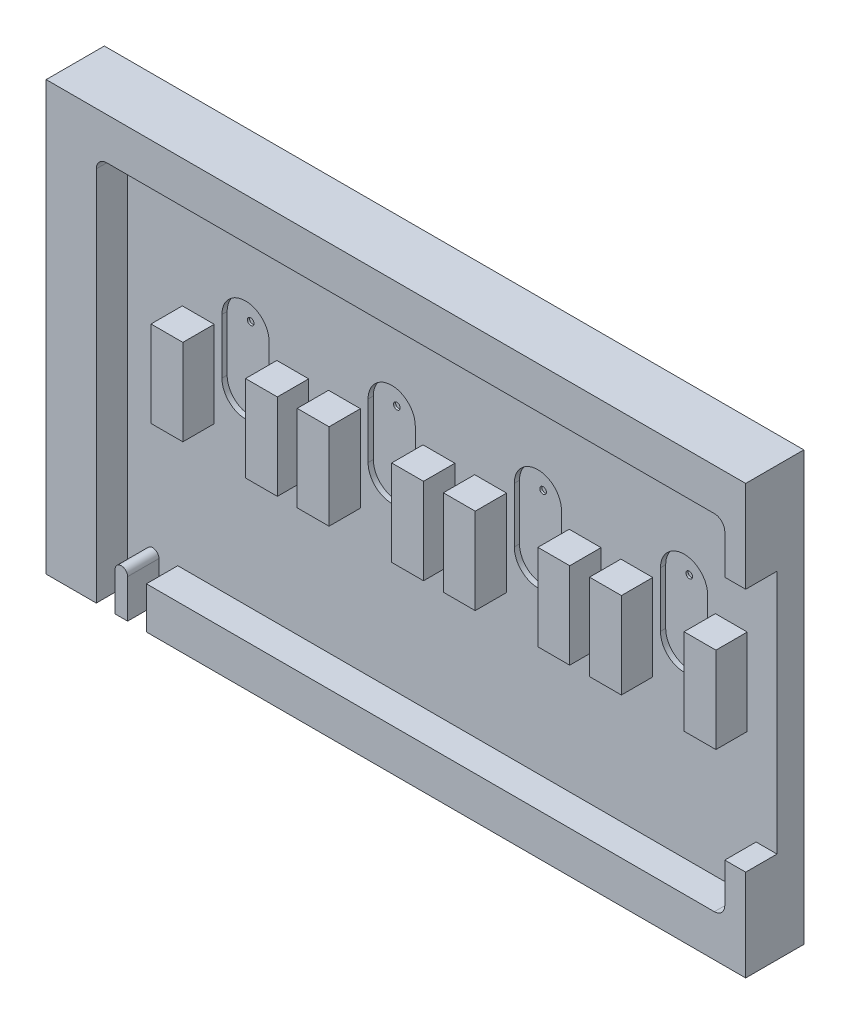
ISO-10303-21;
HEADER;
FILE_DESCRIPTION(('STEP AP214'),'2;1');
FILE_NAME('part.step','',(''),(''),'','','');
FILE_SCHEMA(('AUTOMOTIVE_DESIGN { 1 0 10303 214 1 1 1 1 }'));
ENDSEC;
DATA;
#1=APPLICATION_CONTEXT('core data for automotive mechanical design processes');
#2=APPLICATION_PROTOCOL_DEFINITION('international standard','automotive_design',2000,#1);
#3=PRODUCT_CONTEXT('',#1,'mechanical');
#4=PRODUCT('Part','Part','',(#3));
#5=PRODUCT_RELATED_PRODUCT_CATEGORY('part','',(#4));
#6=PRODUCT_DEFINITION_FORMATION('','',#4);
#7=PRODUCT_DEFINITION_CONTEXT('part definition',#1,'design');
#8=PRODUCT_DEFINITION('design','',#6,#7);
#9=PRODUCT_DEFINITION_SHAPE('','',#8);
#10=(LENGTH_UNIT() NAMED_UNIT(*) SI_UNIT(.MILLI.,.METRE.));
#11=(NAMED_UNIT(*) PLANE_ANGLE_UNIT() SI_UNIT($,.RADIAN.));
#12=(NAMED_UNIT(*) SI_UNIT($,.STERADIAN.) SOLID_ANGLE_UNIT());
#13=UNCERTAINTY_MEASURE_WITH_UNIT(LENGTH_MEASURE(1.E-05),#10,'distance_accuracy_value','');
#14=(GEOMETRIC_REPRESENTATION_CONTEXT(3) GLOBAL_UNCERTAINTY_ASSIGNED_CONTEXT((#13)) GLOBAL_UNIT_ASSIGNED_CONTEXT((#10,
#11,#12)) REPRESENTATION_CONTEXT('',''));
#15=CARTESIAN_POINT('',(0.,0.,0.));
#16=DIRECTION('',(0.,0.,1.));
#17=DIRECTION('',(1.,0.,0.));
#18=AXIS2_PLACEMENT_3D('',#15,#16,#17);
#19=CARTESIAN_POINT('',(-3.29,18.86,-41.4488709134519));
#20=DIRECTION('',(0.,0.,-1.));
#21=DIRECTION('',(-1.,0.,0.));
#22=AXIS2_PLACEMENT_3D('',#19,#20,#21);
#23=CYLINDRICAL_SURFACE('',#22,1.);
#24=DIRECTION('',(0.,0.,1.));
#25=VECTOR('',#24,1.);
#26=CARTESIAN_POINT('',(-4.29,18.86,-41.4488709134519));
#27=LINE('',#26,#25);
#28=CARTESIAN_POINT('',(-4.29,18.86,0.));
#29=VERTEX_POINT('',#28);
#30=CARTESIAN_POINT('',(-4.29,18.86,3.));
#31=VERTEX_POINT('',#30);
#32=EDGE_CURVE('E781',#29,#31,#27,.T.);
#33=ORIENTED_EDGE('',*,*,#32,.F.);
#34=CARTESIAN_POINT('',(-3.29,18.86,0.));
#35=DIRECTION('',(0.,0.,-1.));
#36=DIRECTION('',(-1.,0.,0.));
#37=AXIS2_PLACEMENT_3D('',#34,#35,#36);
#38=CIRCLE('',#37,1.);
#39=CARTESIAN_POINT('',(-3.29,19.86,0.));
#40=VERTEX_POINT('',#39);
#41=EDGE_CURVE('E40',#40,#29,#38,.F.);
#42=ORIENTED_EDGE('',*,*,#41,.F.);
#43=DIRECTION('',(0.,0.,1.));
#44=VECTOR('',#43,1.);
#45=CARTESIAN_POINT('',(-3.29,19.86,-41.4488709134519));
#46=LINE('',#45,#44);
#47=CARTESIAN_POINT('',(-3.29,19.86,3.));
#48=VERTEX_POINT('',#47);
#49=EDGE_CURVE('E784',#48,#40,#46,.F.);
#50=ORIENTED_EDGE('',*,*,#49,.F.);
#51=CARTESIAN_POINT('',(-3.29,18.86,3.));
#52=DIRECTION('',(0.,0.,1.));
#53=DIRECTION('',(1.,0.,0.));
#54=AXIS2_PLACEMENT_3D('',#51,#52,#53);
#55=CIRCLE('',#54,1.);
#56=EDGE_CURVE('E11',#48,#31,#55,.T.);
#57=ORIENTED_EDGE('',*,*,#56,.T.);
#58=EDGE_LOOP('',(#33,#42,#50,#57));
#59=FACE_BOUND('',#58,.T.);
#60=ADVANCED_FACE('F33',(#59),#23,.F.);
#61=CARTESIAN_POINT('',(0.,0.,0.));
#62=DIRECTION('',(0.,0.,-1.));
#63=DIRECTION('',(-1.,0.,0.));
#64=AXIS2_PLACEMENT_3D('',#61,#62,#63);
#65=PLANE('',#64);
#66=DIRECTION('',(0.,1.,0.));
#67=VECTOR('',#66,1.);
#68=CARTESIAN_POINT('',(55.05,0.36,0.));
#69=LINE('',#68,#67);
#70=CARTESIAN_POINT('',(55.05,0.36,0.));
#71=VERTEX_POINT('',#70);
#72=CARTESIAN_POINT('',(55.05,8.61,0.));
#73=VERTEX_POINT('',#72);
#74=EDGE_CURVE('E621',#71,#73,#69,.T.);
#75=ORIENTED_EDGE('',*,*,#74,.F.);
#76=DIRECTION('',(1.,0.,0.));
#77=VECTOR('',#76,1.);
#78=CARTESIAN_POINT('',(52.,0.36,0.));
#79=LINE('',#78,#77);
#80=CARTESIAN_POINT('',(52.,0.36,0.));
#81=VERTEX_POINT('',#80);
#82=EDGE_CURVE('E926',#81,#71,#79,.T.);
#83=ORIENTED_EDGE('',*,*,#82,.F.);
#84=DIRECTION('',(0.,-1.,0.));
#85=VECTOR('',#84,1.);
#86=CARTESIAN_POINT('',(52.,8.61,0.));
#87=LINE('',#86,#85);
#88=CARTESIAN_POINT('',(52.,8.61,0.));
#89=VERTEX_POINT('',#88);
#90=EDGE_CURVE('E921',#89,#81,#87,.T.);
#91=ORIENTED_EDGE('',*,*,#90,.F.);
#92=DIRECTION('',(-1.,0.,0.));
#93=VECTOR('',#92,1.);
#94=CARTESIAN_POINT('',(54.3,8.61,0.));
#95=LINE('',#94,#93);
#96=EDGE_CURVE('E924',#73,#89,#95,.T.);
#97=ORIENTED_EDGE('',*,*,#96,.F.);
#98=EDGE_LOOP('',(#75,#83,#91,#97));
#99=FACE_BOUND('',#98,.T.);
#100=DIRECTION('',(0.,-1.,0.));
#101=VECTOR('',#100,1.);
#102=CARTESIAN_POINT('',(42.95,0.359999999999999,0.));
#103=LINE('',#102,#101);
#104=CARTESIAN_POINT('',(42.95,8.61,0.));
#105=VERTEX_POINT('',#104);
#106=CARTESIAN_POINT('',(42.95,0.359999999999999,0.));
#107=VERTEX_POINT('',#106);
#108=EDGE_CURVE('E609',#105,#107,#103,.T.);
#109=ORIENTED_EDGE('',*,*,#108,.F.);
#110=DIRECTION('',(-1.,0.,0.));
#111=VECTOR('',#110,1.);
#112=CARTESIAN_POINT('',(43.7,8.61,0.));
#113=LINE('',#112,#111);
#114=CARTESIAN_POINT('',(46.,8.61,0.));
#115=VERTEX_POINT('',#114);
#116=EDGE_CURVE('E908',#115,#105,#113,.T.);
#117=ORIENTED_EDGE('',*,*,#116,.F.);
#118=DIRECTION('',(0.,1.,0.));
#119=VECTOR('',#118,1.);
#120=CARTESIAN_POINT('',(46.,8.61,0.));
#121=LINE('',#120,#119);
#122=CARTESIAN_POINT('',(46.,0.36,0.));
#123=VERTEX_POINT('',#122);
#124=EDGE_CURVE('E910',#123,#115,#121,.T.);
#125=ORIENTED_EDGE('',*,*,#124,.F.);
#126=DIRECTION('',(1.,0.,0.));
#127=VECTOR('',#126,1.);
#128=CARTESIAN_POINT('',(46.,0.36,0.));
#129=LINE('',#128,#127);
#130=EDGE_CURVE('E913',#107,#123,#129,.T.);
#131=ORIENTED_EDGE('',*,*,#130,.F.);
#132=EDGE_LOOP('',(#109,#117,#125,#131));
#133=FACE_BOUND('',#132,.T.);
#134=DIRECTION('',(0.,1.,0.));
#135=VECTOR('',#134,1.);
#136=CARTESIAN_POINT('',(41.05,0.36,0.));
#137=LINE('',#136,#135);
#138=CARTESIAN_POINT('',(41.05,0.36,0.));
#139=VERTEX_POINT('',#138);
#140=CARTESIAN_POINT('',(41.05,8.61,0.));
#141=VERTEX_POINT('',#140);
#142=EDGE_CURVE('E597',#139,#141,#137,.T.);
#143=ORIENTED_EDGE('',*,*,#142,.F.);
#144=DIRECTION('',(1.,0.,0.));
#145=VECTOR('',#144,1.);
#146=CARTESIAN_POINT('',(38.,0.36,0.));
#147=LINE('',#146,#145);
#148=CARTESIAN_POINT('',(38.,0.36,0.));
#149=VERTEX_POINT('',#148);
#150=EDGE_CURVE('E900',#149,#139,#147,.T.);
#151=ORIENTED_EDGE('',*,*,#150,.F.);
#152=DIRECTION('',(0.,-1.,0.));
#153=VECTOR('',#152,1.);
#154=CARTESIAN_POINT('',(38.,8.61,0.));
#155=LINE('',#154,#153);
#156=CARTESIAN_POINT('',(38.,8.61,0.));
#157=VERTEX_POINT('',#156);
#158=EDGE_CURVE('E894',#157,#149,#155,.T.);
#159=ORIENTED_EDGE('',*,*,#158,.F.);
#160=DIRECTION('',(-1.,0.,0.));
#161=VECTOR('',#160,1.);
#162=CARTESIAN_POINT('',(40.3,8.61,0.));
#163=LINE('',#162,#161);
#164=EDGE_CURVE('E897',#141,#157,#163,.T.);
#165=ORIENTED_EDGE('',*,*,#164,.F.);
#166=EDGE_LOOP('',(#143,#151,#159,#165));
#167=FACE_BOUND('',#166,.T.);
#168=DIRECTION('',(0.,-1.,0.));
#169=VECTOR('',#168,1.);
#170=CARTESIAN_POINT('',(28.95,0.36,0.));
#171=LINE('',#170,#169);
#172=CARTESIAN_POINT('',(28.95,8.61,0.));
#173=VERTEX_POINT('',#172);
#174=CARTESIAN_POINT('',(28.95,0.36,0.));
#175=VERTEX_POINT('',#174);
#176=EDGE_CURVE('E585',#173,#175,#171,.T.);
#177=ORIENTED_EDGE('',*,*,#176,.F.);
#178=DIRECTION('',(-1.,0.,0.));
#179=VECTOR('',#178,1.);
#180=CARTESIAN_POINT('',(29.7,8.61,0.));
#181=LINE('',#180,#179);
#182=CARTESIAN_POINT('',(32.,8.61,0.));
#183=VERTEX_POINT('',#182);
#184=EDGE_CURVE('E880',#183,#173,#181,.T.);
#185=ORIENTED_EDGE('',*,*,#184,.F.);
#186=DIRECTION('',(0.,1.,0.));
#187=VECTOR('',#186,1.);
#188=CARTESIAN_POINT('',(32.,8.61,0.));
#189=LINE('',#188,#187);
#190=CARTESIAN_POINT('',(32.,0.36,0.));
#191=VERTEX_POINT('',#190);
#192=EDGE_CURVE('E882',#191,#183,#189,.T.);
#193=ORIENTED_EDGE('',*,*,#192,.F.);
#194=DIRECTION('',(1.,0.,0.));
#195=VECTOR('',#194,1.);
#196=CARTESIAN_POINT('',(32.,0.36,0.));
#197=LINE('',#196,#195);
#198=EDGE_CURVE('E885',#175,#191,#197,.T.);
#199=ORIENTED_EDGE('',*,*,#198,.F.);
#200=EDGE_LOOP('',(#177,#185,#193,#199));
#201=FACE_BOUND('',#200,.T.);
#202=DIRECTION('',(0.,1.,0.));
#203=VECTOR('',#202,1.);
#204=CARTESIAN_POINT('',(27.05,0.360000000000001,0.));
#205=LINE('',#204,#203);
#206=CARTESIAN_POINT('',(27.05,0.360000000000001,0.));
#207=VERTEX_POINT('',#206);
#208=CARTESIAN_POINT('',(27.05,8.61,0.));
#209=VERTEX_POINT('',#208);
#210=EDGE_CURVE('E573',#207,#209,#205,.T.);
#211=ORIENTED_EDGE('',*,*,#210,.F.);
#212=DIRECTION('',(1.,0.,0.));
#213=VECTOR('',#212,1.);
#214=CARTESIAN_POINT('',(24.,0.36,0.));
#215=LINE('',#214,#213);
#216=CARTESIAN_POINT('',(24.,0.36,0.));
#217=VERTEX_POINT('',#216);
#218=EDGE_CURVE('E872',#217,#207,#215,.T.);
#219=ORIENTED_EDGE('',*,*,#218,.F.);
#220=DIRECTION('',(0.,-1.,0.));
#221=VECTOR('',#220,1.);
#222=CARTESIAN_POINT('',(24.,8.61,0.));
#223=LINE('',#222,#221);
#224=CARTESIAN_POINT('',(24.,8.61,0.));
#225=VERTEX_POINT('',#224);
#226=EDGE_CURVE('E866',#225,#217,#223,.T.);
#227=ORIENTED_EDGE('',*,*,#226,.F.);
#228=DIRECTION('',(-1.,0.,0.));
#229=VECTOR('',#228,1.);
#230=CARTESIAN_POINT('',(26.3,8.61,0.));
#231=LINE('',#230,#229);
#232=EDGE_CURVE('E869',#209,#225,#231,.T.);
#233=ORIENTED_EDGE('',*,*,#232,.F.);
#234=EDGE_LOOP('',(#211,#219,#227,#233));
#235=FACE_BOUND('',#234,.T.);
#236=DIRECTION('',(0.,-1.,0.));
#237=VECTOR('',#236,1.);
#238=CARTESIAN_POINT('',(14.95,0.360000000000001,0.));
#239=LINE('',#238,#237);
#240=CARTESIAN_POINT('',(14.95,8.61,0.));
#241=VERTEX_POINT('',#240);
#242=CARTESIAN_POINT('',(14.95,0.360000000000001,0.));
#243=VERTEX_POINT('',#242);
#244=EDGE_CURVE('E561',#241,#243,#239,.T.);
#245=ORIENTED_EDGE('',*,*,#244,.F.);
#246=DIRECTION('',(-1.,0.,0.));
#247=VECTOR('',#246,1.);
#248=CARTESIAN_POINT('',(15.7,8.61,0.));
#249=LINE('',#248,#247);
#250=CARTESIAN_POINT('',(18.,8.61,0.));
#251=VERTEX_POINT('',#250);
#252=EDGE_CURVE('E852',#251,#241,#249,.T.);
#253=ORIENTED_EDGE('',*,*,#252,.F.);
#254=DIRECTION('',(0.,1.,0.));
#255=VECTOR('',#254,1.);
#256=CARTESIAN_POINT('',(18.,8.61,0.));
#257=LINE('',#256,#255);
#258=CARTESIAN_POINT('',(18.,0.36,0.));
#259=VERTEX_POINT('',#258);
#260=EDGE_CURVE('E854',#259,#251,#257,.T.);
#261=ORIENTED_EDGE('',*,*,#260,.F.);
#262=DIRECTION('',(1.,0.,0.));
#263=VECTOR('',#262,1.);
#264=CARTESIAN_POINT('',(18.,0.36,0.));
#265=LINE('',#264,#263);
#266=EDGE_CURVE('E857',#243,#259,#265,.T.);
#267=ORIENTED_EDGE('',*,*,#266,.F.);
#268=EDGE_LOOP('',(#245,#253,#261,#267));
#269=FACE_BOUND('',#268,.T.);
#270=DIRECTION('',(0.,1.,0.));
#271=VECTOR('',#270,1.);
#272=CARTESIAN_POINT('',(13.05,0.360000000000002,0.));
#273=LINE('',#272,#271);
#274=CARTESIAN_POINT('',(13.05,0.360000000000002,0.));
#275=VERTEX_POINT('',#274);
#276=CARTESIAN_POINT('',(13.05,8.61,0.));
#277=VERTEX_POINT('',#276);
#278=EDGE_CURVE('E549',#275,#277,#273,.T.);
#279=ORIENTED_EDGE('',*,*,#278,.F.);
#280=DIRECTION('',(1.,0.,0.));
#281=VECTOR('',#280,1.);
#282=CARTESIAN_POINT('',(9.99999999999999,0.36,0.));
#283=LINE('',#282,#281);
#284=CARTESIAN_POINT('',(9.99999999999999,0.36,0.));
#285=VERTEX_POINT('',#284);
#286=EDGE_CURVE('E844',#285,#275,#283,.T.);
#287=ORIENTED_EDGE('',*,*,#286,.F.);
#288=DIRECTION('',(0.,-1.,0.));
#289=VECTOR('',#288,1.);
#290=CARTESIAN_POINT('',(9.99999999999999,8.61,0.));
#291=LINE('',#290,#289);
#292=CARTESIAN_POINT('',(9.99999999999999,8.61,0.));
#293=VERTEX_POINT('',#292);
#294=EDGE_CURVE('E838',#293,#285,#291,.T.);
#295=ORIENTED_EDGE('',*,*,#294,.F.);
#296=DIRECTION('',(-1.,0.,0.));
#297=VECTOR('',#296,1.);
#298=CARTESIAN_POINT('',(12.3,8.61,0.));
#299=LINE('',#298,#297);
#300=EDGE_CURVE('E841',#277,#293,#299,.T.);
#301=ORIENTED_EDGE('',*,*,#300,.F.);
#302=EDGE_LOOP('',(#279,#287,#295,#301));
#303=FACE_BOUND('',#302,.T.);
#304=DIRECTION('',(0.,-1.,0.));
#305=VECTOR('',#304,1.);
#306=CARTESIAN_POINT('',(0.949999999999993,0.360000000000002,0.));
#307=LINE('',#306,#305);
#308=CARTESIAN_POINT('',(0.949999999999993,8.61,0.));
#309=VERTEX_POINT('',#308);
#310=CARTESIAN_POINT('',(0.949999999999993,0.360000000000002,0.));
#311=VERTEX_POINT('',#310);
#312=EDGE_CURVE('E537',#309,#311,#307,.T.);
#313=ORIENTED_EDGE('',*,*,#312,.F.);
#314=DIRECTION('',(-1.,0.,0.));
#315=VECTOR('',#314,1.);
#316=CARTESIAN_POINT('',(1.7,8.61,0.));
#317=LINE('',#316,#315);
#318=CARTESIAN_POINT('',(3.99999999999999,8.61,0.));
#319=VERTEX_POINT('',#318);
#320=EDGE_CURVE('E822',#319,#309,#317,.T.);
#321=ORIENTED_EDGE('',*,*,#320,.F.);
#322=DIRECTION('',(0.,1.,0.));
#323=VECTOR('',#322,1.);
#324=CARTESIAN_POINT('',(3.99999999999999,8.61,0.));
#325=LINE('',#324,#323);
#326=CARTESIAN_POINT('',(4.,0.36,0.));
#327=VERTEX_POINT('',#326);
#328=EDGE_CURVE('E825',#327,#319,#325,.T.);
#329=ORIENTED_EDGE('',*,*,#328,.F.);
#330=DIRECTION('',(1.,0.,0.));
#331=VECTOR('',#330,1.);
#332=CARTESIAN_POINT('',(4.,0.36,0.));
#333=LINE('',#332,#331);
#334=EDGE_CURVE('E829',#311,#327,#333,.T.);
#335=ORIENTED_EDGE('',*,*,#334,.F.);
#336=EDGE_LOOP('',(#313,#321,#329,#335));
#337=FACE_BOUND('',#336,.T.);
#338=DIRECTION('',(0.,-1.,0.));
#339=VECTOR('',#338,1.);
#340=CARTESIAN_POINT('',(4.73999999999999,4.980113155,0.));
#341=LINE('',#340,#339);
#342=CARTESIAN_POINT('',(4.73999999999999,9.788786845,0.));
#343=VERTEX_POINT('',#342);
#344=CARTESIAN_POINT('',(4.73999999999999,4.511213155,0.));
#345=VERTEX_POINT('',#344);
#346=EDGE_CURVE('E953',#343,#345,#341,.T.);
#347=ORIENTED_EDGE('',*,*,#346,.F.);
#348=CARTESIAN_POINT('',(6.99999999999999,9.788786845,0.));
#349=DIRECTION('',(0.,0.,1.));
#350=DIRECTION('',(1.,0.,0.));
#351=AXIS2_PLACEMENT_3D('',#348,#349,#350);
#352=CIRCLE('',#351,2.26);
#353=CARTESIAN_POINT('',(9.26,9.788786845,0.));
#354=VERTEX_POINT('',#353);
#355=EDGE_CURVE('E956',#354,#343,#352,.T.);
#356=ORIENTED_EDGE('',*,*,#355,.F.);
#357=DIRECTION('',(0.,1.,0.));
#358=VECTOR('',#357,1.);
#359=CARTESIAN_POINT('',(9.26,9.788786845,0.));
#360=LINE('',#359,#358);
#361=CARTESIAN_POINT('',(9.26,4.511213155,0.));
#362=VERTEX_POINT('',#361);
#363=EDGE_CURVE('E947',#362,#354,#360,.T.);
#364=ORIENTED_EDGE('',*,*,#363,.F.);
#365=CARTESIAN_POINT('',(6.99999999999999,4.511213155,0.));
#366=DIRECTION('',(0.,0.,1.));
#367=DIRECTION('',(1.,0.,0.));
#368=AXIS2_PLACEMENT_3D('',#365,#366,#367);
#369=CIRCLE('',#368,2.26);
#370=EDGE_CURVE('E950',#345,#362,#369,.T.);
#371=ORIENTED_EDGE('',*,*,#370,.F.);
#372=EDGE_LOOP('',(#347,#356,#364,#371));
#373=FACE_BOUND('',#372,.T.);
#374=DIRECTION('',(0.,-1.,0.));
#375=VECTOR('',#374,1.);
#376=CARTESIAN_POINT('',(18.74,4.980113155,0.));
#377=LINE('',#376,#375);
#378=CARTESIAN_POINT('',(18.74,9.788786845,0.));
#379=VERTEX_POINT('',#378);
#380=CARTESIAN_POINT('',(18.74,4.511213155,0.));
#381=VERTEX_POINT('',#380);
#382=EDGE_CURVE('E995',#379,#381,#377,.T.);
#383=ORIENTED_EDGE('',*,*,#382,.F.);
#384=CARTESIAN_POINT('',(21.,9.788786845,0.));
#385=DIRECTION('',(0.,0.,1.));
#386=DIRECTION('',(1.,0.,0.));
#387=AXIS2_PLACEMENT_3D('',#384,#385,#386);
#388=CIRCLE('',#387,2.26);
#389=CARTESIAN_POINT('',(23.26,9.788786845,0.));
#390=VERTEX_POINT('',#389);
#391=EDGE_CURVE('E998',#390,#379,#388,.T.);
#392=ORIENTED_EDGE('',*,*,#391,.F.);
#393=DIRECTION('',(0.,1.,0.));
#394=VECTOR('',#393,1.);
#395=CARTESIAN_POINT('',(23.26,9.788786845,0.));
#396=LINE('',#395,#394);
#397=CARTESIAN_POINT('',(23.26,4.511213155,0.));
#398=VERTEX_POINT('',#397);
#399=EDGE_CURVE('E989',#398,#390,#396,.T.);
#400=ORIENTED_EDGE('',*,*,#399,.F.);
#401=CARTESIAN_POINT('',(21.,4.511213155,0.));
#402=DIRECTION('',(0.,0.,1.));
#403=DIRECTION('',(1.,0.,0.));
#404=AXIS2_PLACEMENT_3D('',#401,#402,#403);
#405=CIRCLE('',#404,2.26);
#406=EDGE_CURVE('E992',#381,#398,#405,.T.);
#407=ORIENTED_EDGE('',*,*,#406,.F.);
#408=EDGE_LOOP('',(#383,#392,#400,#407));
#409=FACE_BOUND('',#408,.T.);
#410=DIRECTION('',(0.,-1.,0.));
#411=VECTOR('',#410,1.);
#412=CARTESIAN_POINT('',(32.74,4.980113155,0.));
#413=LINE('',#412,#411);
#414=CARTESIAN_POINT('',(32.74,9.788786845,0.));
#415=VERTEX_POINT('',#414);
#416=CARTESIAN_POINT('',(32.74,4.511213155,0.));
#417=VERTEX_POINT('',#416);
#418=EDGE_CURVE('E1025',#415,#417,#413,.T.);
#419=ORIENTED_EDGE('',*,*,#418,.F.);
#420=CARTESIAN_POINT('',(35.,9.788786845,0.));
#421=DIRECTION('',(0.,0.,1.));
#422=DIRECTION('',(1.,0.,0.));
#423=AXIS2_PLACEMENT_3D('',#420,#421,#422);
#424=CIRCLE('',#423,2.26);
#425=CARTESIAN_POINT('',(37.26,9.788786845,0.));
#426=VERTEX_POINT('',#425);
#427=EDGE_CURVE('E1028',#426,#415,#424,.T.);
#428=ORIENTED_EDGE('',*,*,#427,.F.);
#429=DIRECTION('',(0.,1.,0.));
#430=VECTOR('',#429,1.);
#431=CARTESIAN_POINT('',(37.26,9.788786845,0.));
#432=LINE('',#431,#430);
#433=CARTESIAN_POINT('',(37.26,4.511213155,0.));
#434=VERTEX_POINT('',#433);
#435=EDGE_CURVE('E1019',#434,#426,#432,.T.);
#436=ORIENTED_EDGE('',*,*,#435,.F.);
#437=CARTESIAN_POINT('',(35.,4.511213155,0.));
#438=DIRECTION('',(0.,0.,1.));
#439=DIRECTION('',(1.,0.,0.));
#440=AXIS2_PLACEMENT_3D('',#437,#438,#439);
#441=CIRCLE('',#440,2.26);
#442=EDGE_CURVE('E1022',#417,#434,#441,.T.);
#443=ORIENTED_EDGE('',*,*,#442,.F.);
#444=EDGE_LOOP('',(#419,#428,#436,#443));
#445=FACE_BOUND('',#444,.T.);
#446=DIRECTION('',(0.,-1.,0.));
#447=VECTOR('',#446,1.);
#448=CARTESIAN_POINT('',(46.74,4.980113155,0.));
#449=LINE('',#448,#447);
#450=CARTESIAN_POINT('',(46.74,9.788786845,0.));
#451=VERTEX_POINT('',#450);
#452=CARTESIAN_POINT('',(46.74,4.511213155,0.));
#453=VERTEX_POINT('',#452);
#454=EDGE_CURVE('E1055',#451,#453,#449,.T.);
#455=ORIENTED_EDGE('',*,*,#454,.F.);
#456=CARTESIAN_POINT('',(49.,9.788786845,0.));
#457=DIRECTION('',(0.,0.,1.));
#458=DIRECTION('',(1.,0.,0.));
#459=AXIS2_PLACEMENT_3D('',#456,#457,#458);
#460=CIRCLE('',#459,2.26);
#461=CARTESIAN_POINT('',(51.26,9.788786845,0.));
#462=VERTEX_POINT('',#461);
#463=EDGE_CURVE('E1058',#462,#451,#460,.T.);
#464=ORIENTED_EDGE('',*,*,#463,.F.);
#465=DIRECTION('',(0.,1.,0.));
#466=VECTOR('',#465,1.);
#467=CARTESIAN_POINT('',(51.26,9.788786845,0.));
#468=LINE('',#467,#466);
#469=CARTESIAN_POINT('',(51.26,4.511213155,0.));
#470=VERTEX_POINT('',#469);
#471=EDGE_CURVE('E1049',#470,#462,#468,.T.);
#472=ORIENTED_EDGE('',*,*,#471,.F.);
#473=CARTESIAN_POINT('',(49.,4.511213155,0.));
#474=DIRECTION('',(0.,0.,1.));
#475=DIRECTION('',(1.,0.,0.));
#476=AXIS2_PLACEMENT_3D('',#473,#474,#475);
#477=CIRCLE('',#476,2.26);
#478=EDGE_CURVE('E1052',#453,#470,#477,.T.);
#479=ORIENTED_EDGE('',*,*,#478,.F.);
#480=EDGE_LOOP('',(#455,#464,#472,#479));
#481=FACE_BOUND('',#480,.T.);
#482=DIRECTION('',(1.,0.,0.));
#483=VECTOR('',#482,1.);
#484=CARTESIAN_POINT('',(-4.,19.86,0.));
#485=LINE('',#484,#483);
#486=CARTESIAN_POINT('',(54.9,19.86,0.));
#487=VERTEX_POINT('',#486);
#488=EDGE_CURVE('E756',#40,#487,#485,.T.);
#489=ORIENTED_EDGE('',*,*,#488,.F.);
#490=ORIENTED_EDGE('',*,*,#41,.T.);
#491=DIRECTION('',(0.,-1.,0.));
#492=VECTOR('',#491,1.);
#493=CARTESIAN_POINT('',(-4.29,-21.31,0.));
#494=LINE('',#493,#492);
#495=CARTESIAN_POINT('',(-4.29,-17.16,0.));
#496=VERTEX_POINT('',#495);
#497=EDGE_CURVE('E472',#29,#496,#494,.T.);
#498=ORIENTED_EDGE('',*,*,#497,.T.);
#499=DIRECTION('',(1.,0.,0.));
#500=VECTOR('',#499,1.);
#501=CARTESIAN_POINT('',(0.,-17.16,0.));
#502=LINE('',#501,#500);
#503=CARTESIAN_POINT('',(-2.49,-17.16,0.));
#504=VERTEX_POINT('',#503);
#505=EDGE_CURVE('E520',#496,#504,#502,.T.);
#506=ORIENTED_EDGE('',*,*,#505,.T.);
#507=DIRECTION('',(0.,-1.,0.));
#508=VECTOR('',#507,1.);
#509=CARTESIAN_POINT('',(-2.49,-21.31,0.));
#510=LINE('',#509,#508);
#511=CARTESIAN_POINT('',(-2.49,-13.4652151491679,0.));
#512=VERTEX_POINT('',#511);
#513=EDGE_CURVE('E733',#512,#504,#510,.T.);
#514=ORIENTED_EDGE('',*,*,#513,.F.);
#515=CARTESIAN_POINT('',(-1.89,-13.4652151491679,0.));
#516=DIRECTION('',(0.,0.,1.));
#517=DIRECTION('',(1.,0.,0.));
#518=AXIS2_PLACEMENT_3D('',#515,#516,#517);
#519=CIRCLE('',#518,0.6);
#520=CARTESIAN_POINT('',(-1.29,-13.4652151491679,0.));
#521=VERTEX_POINT('',#520);
#522=EDGE_CURVE('E737',#521,#512,#519,.T.);
#523=ORIENTED_EDGE('',*,*,#522,.F.);
#524=DIRECTION('',(0.,1.,0.));
#525=VECTOR('',#524,1.);
#526=CARTESIAN_POINT('',(-1.29,-21.31,0.));
#527=LINE('',#526,#525);
#528=CARTESIAN_POINT('',(-1.29,-17.16,0.));
#529=VERTEX_POINT('',#528);
#530=EDGE_CURVE('E732',#529,#521,#527,.T.);
#531=ORIENTED_EDGE('',*,*,#530,.F.);
#532=CARTESIAN_POINT('',(0.510000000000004,-17.16,0.));
#533=VERTEX_POINT('',#532);
#534=EDGE_CURVE('E524',#529,#533,#502,.T.);
#535=ORIENTED_EDGE('',*,*,#534,.T.);
#536=DIRECTION('',(0.,1.,0.));
#537=VECTOR('',#536,1.);
#538=CARTESIAN_POINT('',(0.510000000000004,-13.16,0.));
#539=LINE('',#538,#537);
#540=CARTESIAN_POINT('',(0.510000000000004,-13.16,0.));
#541=VERTEX_POINT('',#540);
#542=EDGE_CURVE('E755',#533,#541,#539,.T.);
#543=ORIENTED_EDGE('',*,*,#542,.T.);
#544=DIRECTION('',(1.,0.,0.));
#545=VECTOR('',#544,1.);
#546=CARTESIAN_POINT('',(-4.,-13.16,0.));
#547=LINE('',#546,#545);
#548=CARTESIAN_POINT('',(54.9,-13.16,0.));
#549=VERTEX_POINT('',#548);
#550=EDGE_CURVE('E761',#541,#549,#547,.T.);
#551=ORIENTED_EDGE('',*,*,#550,.T.);
#552=CARTESIAN_POINT('',(54.9,-12.16,0.));
#553=DIRECTION('',(0.,0.,-1.));
#554=DIRECTION('',(-1.,0.,0.));
#555=AXIS2_PLACEMENT_3D('',#552,#553,#554);
#556=CIRCLE('',#555,1.);
#557=CARTESIAN_POINT('',(55.9,-12.16,0.));
#558=VERTEX_POINT('',#557);
#559=EDGE_CURVE('E807',#549,#558,#556,.F.);
#560=ORIENTED_EDGE('',*,*,#559,.T.);
#561=DIRECTION('',(0.,-1.,0.));
#562=VECTOR('',#561,1.);
#563=CARTESIAN_POINT('',(55.9,-13.16,0.));
#564=LINE('',#563,#562);
#565=CARTESIAN_POINT('',(55.9000000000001,-8.38,0.));
#566=VERTEX_POINT('',#565);
#567=EDGE_CURVE('E758',#566,#558,#564,.T.);
#568=ORIENTED_EDGE('',*,*,#567,.F.);
#569=DIRECTION('',(-1.,0.,0.));
#570=VECTOR('',#569,1.);
#571=CARTESIAN_POINT('',(55.9000000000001,-8.38,0.));
#572=LINE('',#571,#570);
#573=CARTESIAN_POINT('',(57.9,-8.38,0.));
#574=VERTEX_POINT('',#573);
#575=EDGE_CURVE('E495',#574,#566,#572,.T.);
#576=ORIENTED_EDGE('',*,*,#575,.F.);
#577=DIRECTION('',(0.,-1.,0.));
#578=VECTOR('',#577,1.);
#579=CARTESIAN_POINT('',(57.9,-17.16,0.));
#580=LINE('',#579,#578);
#581=CARTESIAN_POINT('',(57.9,15.08,0.));
#582=VERTEX_POINT('',#581);
#583=EDGE_CURVE('E774',#582,#574,#580,.T.);
#584=ORIENTED_EDGE('',*,*,#583,.F.);
#585=DIRECTION('',(1.,0.,0.));
#586=VECTOR('',#585,1.);
#587=CARTESIAN_POINT('',(55.9000000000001,15.08,0.));
#588=LINE('',#587,#586);
#589=CARTESIAN_POINT('',(55.9000000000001,15.08,0.));
#590=VERTEX_POINT('',#589);
#591=EDGE_CURVE('E505',#590,#582,#588,.T.);
#592=ORIENTED_EDGE('',*,*,#591,.F.);
#593=CARTESIAN_POINT('',(55.9,18.86,0.));
#594=VERTEX_POINT('',#593);
#595=EDGE_CURVE('E759',#594,#590,#564,.T.);
#596=ORIENTED_EDGE('',*,*,#595,.F.);
#597=CARTESIAN_POINT('',(54.9,18.86,0.));
#598=DIRECTION('',(0.,0.,-1.));
#599=DIRECTION('',(-1.,0.,0.));
#600=AXIS2_PLACEMENT_3D('',#597,#598,#599);
#601=CIRCLE('',#600,1.);
#602=EDGE_CURVE('E797',#594,#487,#601,.F.);
#603=ORIENTED_EDGE('',*,*,#602,.T.);
#604=EDGE_LOOP('',(#489,#490,#498,#506,#514,#523,#531,#535,#543,#551,#560,#568,#576,#584,#592,
#596,#603));
#605=FACE_BOUND('',#604,.T.);
#606=ADVANCED_FACE('F787',(#99,#133,#167,#201,#235,#269,#303,#337,#373,#409,#445,#481,#605),#65,.F.);
#607=CARTESIAN_POINT('',(54.9,18.86,83.3759714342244));
#608=DIRECTION('',(0.,0.,1.));
#609=DIRECTION('',(1.,0.,0.));
#610=AXIS2_PLACEMENT_3D('',#607,#608,#609);
#611=CYLINDRICAL_SURFACE('',#610,1.);
#612=DIRECTION('',(0.,0.,-1.));
#613=VECTOR('',#612,1.);
#614=CARTESIAN_POINT('',(55.9,18.86,83.3759714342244));
#615=LINE('',#614,#613);
#616=CARTESIAN_POINT('',(55.9,18.86,3.));
#617=VERTEX_POINT('',#616);
#618=EDGE_CURVE('E802',#617,#594,#615,.T.);
#619=ORIENTED_EDGE('',*,*,#618,.F.);
#620=CARTESIAN_POINT('',(54.9,18.86,3.));
#621=DIRECTION('',(0.,0.,-1.));
#622=DIRECTION('',(1.,0.,0.));
#623=AXIS2_PLACEMENT_3D('',#620,#621,#622);
#624=CIRCLE('',#623,0.999999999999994);
#625=CARTESIAN_POINT('',(54.9,19.86,3.));
#626=VERTEX_POINT('',#625);
#627=EDGE_CURVE('E695',#626,#617,#624,.T.);
#628=ORIENTED_EDGE('',*,*,#627,.F.);
#629=DIRECTION('',(0.,0.,-1.));
#630=VECTOR('',#629,1.);
#631=CARTESIAN_POINT('',(54.9,19.86,83.3759714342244));
#632=LINE('',#631,#630);
#633=EDGE_CURVE('E798',#487,#626,#632,.F.);
#634=ORIENTED_EDGE('',*,*,#633,.F.);
#635=ORIENTED_EDGE('',*,*,#602,.F.);
#636=EDGE_LOOP('',(#619,#628,#634,#635));
#637=FACE_BOUND('',#636,.T.);
#638=ADVANCED_FACE('F1125',(#637),#611,.F.);
#639=CARTESIAN_POINT('',(54.9,-12.16,83.3759714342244));
#640=DIRECTION('',(0.,0.,-1.));
#641=DIRECTION('',(-1.,0.,0.));
#642=AXIS2_PLACEMENT_3D('',#639,#640,#641);
#643=CYLINDRICAL_SURFACE('',#642,1.);
#644=DIRECTION('',(0.,0.,1.));
#645=VECTOR('',#644,1.);
#646=CARTESIAN_POINT('',(55.9,-12.16,83.3759714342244));
#647=LINE('',#646,#645);
#648=CARTESIAN_POINT('',(55.9,-12.16,3.));
#649=VERTEX_POINT('',#648);
#650=EDGE_CURVE('E811',#558,#649,#647,.T.);
#651=ORIENTED_EDGE('',*,*,#650,.F.);
#652=ORIENTED_EDGE('',*,*,#559,.F.);
#653=DIRECTION('',(0.,0.,1.));
#654=VECTOR('',#653,1.);
#655=CARTESIAN_POINT('',(54.9,-13.16,83.3759714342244));
#656=LINE('',#655,#654);
#657=CARTESIAN_POINT('',(54.9,-13.16,3.));
#658=VERTEX_POINT('',#657);
#659=EDGE_CURVE('E809',#658,#549,#656,.F.);
#660=ORIENTED_EDGE('',*,*,#659,.F.);
#661=CARTESIAN_POINT('',(54.9,-12.16,3.));
#662=DIRECTION('',(0.,0.,-1.));
#663=DIRECTION('',(1.,0.,0.));
#664=AXIS2_PLACEMENT_3D('',#661,#662,#663);
#665=CIRCLE('',#664,1.);
#666=EDGE_CURVE('E729',#649,#658,#665,.T.);
#667=ORIENTED_EDGE('',*,*,#666,.F.);
#668=EDGE_LOOP('',(#651,#652,#660,#667));
#669=FACE_BOUND('',#668,.T.);
#670=ADVANCED_FACE('F1132',(#669),#643,.F.);
#671=CARTESIAN_POINT('',(55.9,-13.16,83.3759714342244));
#672=DIRECTION('',(1.,0.,0.));
#673=DIRECTION('',(0.,0.,-1.));
#674=AXIS2_PLACEMENT_3D('',#671,#672,#673);
#675=PLANE('',#674);
#676=ORIENTED_EDGE('',*,*,#567,.T.);
#677=ORIENTED_EDGE('',*,*,#650,.T.);
#678=DIRECTION('',(0.,-1.,0.));
#679=VECTOR('',#678,1.);
#680=CARTESIAN_POINT('',(55.9000000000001,-10.16,3.));
#681=LINE('',#680,#679);
#682=CARTESIAN_POINT('',(55.9000000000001,-8.38,3.));
#683=VERTEX_POINT('',#682);
#684=EDGE_CURVE('E726',#683,#649,#681,.T.);
#685=ORIENTED_EDGE('',*,*,#684,.F.);
#686=DIRECTION('',(0.,0.,1.));
#687=VECTOR('',#686,1.);
#688=CARTESIAN_POINT('',(55.9000000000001,-8.38,-2.67738678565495));
#689=LINE('',#688,#687);
#690=EDGE_CURVE('E498',#566,#683,#689,.T.);
#691=ORIENTED_EDGE('',*,*,#690,.F.);
#692=EDGE_LOOP('',(#676,#677,#685,#691));
#693=FACE_BOUND('',#692,.T.);
#694=ADVANCED_FACE('F1141',(#693),#675,.F.);
#695=CARTESIAN_POINT('',(4.,0.36,2.58));
#696=DIRECTION('',(0.,1.,0.));
#697=DIRECTION('',(-1.,0.,0.));
#698=AXIS2_PLACEMENT_3D('',#695,#696,#697);
#699=PLANE('',#698);
#700=ORIENTED_EDGE('',*,*,#334,.T.);
#701=DIRECTION('',(0.,0.,-1.));
#702=VECTOR('',#701,1.);
#703=CARTESIAN_POINT('',(4.,0.36,2.58));
#704=LINE('',#703,#702);
#705=CARTESIAN_POINT('',(4.,0.36,3.));
#706=VERTEX_POINT('',#705);
#707=EDGE_CURVE('E770',#706,#327,#704,.T.);
#708=ORIENTED_EDGE('',*,*,#707,.F.);
#709=DIRECTION('',(1.,0.,0.));
#710=VECTOR('',#709,1.);
#711=CARTESIAN_POINT('',(1.7,0.36,3.));
#712=LINE('',#711,#710);
#713=CARTESIAN_POINT('',(0.949999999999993,0.360000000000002,3.));
#714=VERTEX_POINT('',#713);
#715=EDGE_CURVE('E631',#714,#706,#712,.T.);
#716=ORIENTED_EDGE('',*,*,#715,.F.);
#717=DIRECTION('',(0.,0.,1.));
#718=VECTOR('',#717,1.);
#719=CARTESIAN_POINT('',(0.949999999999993,0.360000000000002,-8.28402076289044));
#720=LINE('',#719,#718);
#721=EDGE_CURVE('E540',#311,#714,#720,.T.);
#722=ORIENTED_EDGE('',*,*,#721,.F.);
#723=EDGE_LOOP('',(#700,#708,#716,#722));
#724=FACE_BOUND('',#723,.T.);
#725=ADVANCED_FACE('F1138',(#724),#699,.F.);
#726=CARTESIAN_POINT('',(3.99999999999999,8.61,2.58));
#727=DIRECTION('',(-1.,0.,0.));
#728=DIRECTION('',(0.,-1.,0.));
#729=AXIS2_PLACEMENT_3D('',#726,#727,#728);
#730=PLANE('',#729);
#731=ORIENTED_EDGE('',*,*,#328,.T.);
#732=DIRECTION('',(0.,0.,-1.));
#733=VECTOR('',#732,1.);
#734=CARTESIAN_POINT('',(3.99999999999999,8.61,2.58));
#735=LINE('',#734,#733);
#736=CARTESIAN_POINT('',(3.99999999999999,8.61,3.));
#737=VERTEX_POINT('',#736);
#738=EDGE_CURVE('E817',#737,#319,#735,.T.);
#739=ORIENTED_EDGE('',*,*,#738,.F.);
#740=DIRECTION('',(0.,1.,0.));
#741=VECTOR('',#740,1.);
#742=CARTESIAN_POINT('',(4.,0.36,3.));
#743=LINE('',#742,#741);
#744=EDGE_CURVE('E634',#706,#737,#743,.T.);
#745=ORIENTED_EDGE('',*,*,#744,.F.);
#746=ORIENTED_EDGE('',*,*,#707,.T.);
#747=EDGE_LOOP('',(#731,#739,#745,#746));
#748=FACE_BOUND('',#747,.T.);
#749=ADVANCED_FACE('F1499',(#748),#730,.F.);
#750=CARTESIAN_POINT('',(1.7,8.61,2.58));
#751=DIRECTION('',(0.,-1.,0.));
#752=DIRECTION('',(0.,0.,-1.));
#753=AXIS2_PLACEMENT_3D('',#750,#751,#752);
#754=PLANE('',#753);
#755=ORIENTED_EDGE('',*,*,#320,.T.);
#756=DIRECTION('',(0.,0.,1.));
#757=VECTOR('',#756,1.);
#758=CARTESIAN_POINT('',(0.949999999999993,8.61,-8.28402076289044));
#759=LINE('',#758,#757);
#760=CARTESIAN_POINT('',(0.949999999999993,8.61,3.));
#761=VERTEX_POINT('',#760);
#762=EDGE_CURVE('E536',#309,#761,#759,.T.);
#763=ORIENTED_EDGE('',*,*,#762,.T.);
#764=DIRECTION('',(-1.,0.,0.));
#765=VECTOR('',#764,1.);
#766=CARTESIAN_POINT('',(3.99999999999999,8.61,3.));
#767=LINE('',#766,#765);
#768=EDGE_CURVE('E627',#737,#761,#767,.T.);
#769=ORIENTED_EDGE('',*,*,#768,.F.);
#770=ORIENTED_EDGE('',*,*,#738,.T.);
#771=EDGE_LOOP('',(#755,#763,#769,#770));
#772=FACE_BOUND('',#771,.T.);
#773=ADVANCED_FACE('F1496',(#772),#754,.F.);
#774=CARTESIAN_POINT('',(9.99999999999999,0.36,2.58));
#775=DIRECTION('',(0.,1.,0.));
#776=DIRECTION('',(-1.,0.,0.));
#777=AXIS2_PLACEMENT_3D('',#774,#775,#776);
#778=PLANE('',#777);
#779=ORIENTED_EDGE('',*,*,#286,.T.);
#780=DIRECTION('',(0.,0.,1.));
#781=VECTOR('',#780,1.);
#782=CARTESIAN_POINT('',(13.05,0.360000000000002,-8.28402076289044));
#783=LINE('',#782,#781);
#784=CARTESIAN_POINT('',(13.05,0.360000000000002,3.));
#785=VERTEX_POINT('',#784);
#786=EDGE_CURVE('E548',#275,#785,#783,.T.);
#787=ORIENTED_EDGE('',*,*,#786,.T.);
#788=DIRECTION('',(1.,0.,0.));
#789=VECTOR('',#788,1.);
#790=CARTESIAN_POINT('',(9.99999999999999,0.36,3.));
#791=LINE('',#790,#789);
#792=CARTESIAN_POINT('',(9.99999999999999,0.36,3.));
#793=VERTEX_POINT('',#792);
#794=EDGE_CURVE('E640',#793,#785,#791,.T.);
#795=ORIENTED_EDGE('',*,*,#794,.F.);
#796=DIRECTION('',(0.,0.,-1.));
#797=VECTOR('',#796,1.);
#798=CARTESIAN_POINT('',(9.99999999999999,0.36,2.58));
#799=LINE('',#798,#797);
#800=EDGE_CURVE('E835',#793,#285,#799,.T.);
#801=ORIENTED_EDGE('',*,*,#800,.T.);
#802=EDGE_LOOP('',(#779,#787,#795,#801));
#803=FACE_BOUND('',#802,.T.);
#804=ADVANCED_FACE('F1492',(#803),#778,.F.);
#805=CARTESIAN_POINT('',(12.3,8.61,2.58));
#806=DIRECTION('',(0.,-1.,0.));
#807=DIRECTION('',(0.,0.,-1.));
#808=AXIS2_PLACEMENT_3D('',#805,#806,#807);
#809=PLANE('',#808);
#810=ORIENTED_EDGE('',*,*,#300,.T.);
#811=DIRECTION('',(0.,0.,-1.));
#812=VECTOR('',#811,1.);
#813=CARTESIAN_POINT('',(9.99999999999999,8.61,2.58));
#814=LINE('',#813,#812);
#815=CARTESIAN_POINT('',(9.99999999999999,8.61,3.));
#816=VERTEX_POINT('',#815);
#817=EDGE_CURVE('E832',#816,#293,#814,.T.);
#818=ORIENTED_EDGE('',*,*,#817,.F.);
#819=DIRECTION('',(-1.,0.,0.));
#820=VECTOR('',#819,1.);
#821=CARTESIAN_POINT('',(12.3,8.61,3.));
#822=LINE('',#821,#820);
#823=CARTESIAN_POINT('',(13.05,8.61,3.));
#824=VERTEX_POINT('',#823);
#825=EDGE_CURVE('E642',#824,#816,#822,.T.);
#826=ORIENTED_EDGE('',*,*,#825,.F.);
#827=DIRECTION('',(0.,0.,1.));
#828=VECTOR('',#827,1.);
#829=CARTESIAN_POINT('',(13.05,8.61,-8.28402076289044));
#830=LINE('',#829,#828);
#831=EDGE_CURVE('E552',#277,#824,#830,.T.);
#832=ORIENTED_EDGE('',*,*,#831,.F.);
#833=EDGE_LOOP('',(#810,#818,#826,#832));
#834=FACE_BOUND('',#833,.T.);
#835=ADVANCED_FACE('F1488',(#834),#809,.F.);
#836=CARTESIAN_POINT('',(9.99999999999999,8.61,2.58));
#837=DIRECTION('',(1.,0.,0.));
#838=DIRECTION('',(0.,0.,-1.));
#839=AXIS2_PLACEMENT_3D('',#836,#837,#838);
#840=PLANE('',#839);
#841=ORIENTED_EDGE('',*,*,#294,.T.);
#842=ORIENTED_EDGE('',*,*,#800,.F.);
#843=DIRECTION('',(0.,-1.,0.));
#844=VECTOR('',#843,1.);
#845=CARTESIAN_POINT('',(9.99999999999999,8.61,3.));
#846=LINE('',#845,#844);
#847=EDGE_CURVE('E637',#816,#793,#846,.T.);
#848=ORIENTED_EDGE('',*,*,#847,.F.);
#849=ORIENTED_EDGE('',*,*,#817,.T.);
#850=EDGE_LOOP('',(#841,#842,#848,#849));
#851=FACE_BOUND('',#850,.T.);
#852=ADVANCED_FACE('F1484',(#851),#840,.F.);
#853=CARTESIAN_POINT('',(18.,0.36,2.58));
#854=DIRECTION('',(0.,1.,0.));
#855=DIRECTION('',(-1.,0.,0.));
#856=AXIS2_PLACEMENT_3D('',#853,#854,#855);
#857=PLANE('',#856);
#858=ORIENTED_EDGE('',*,*,#266,.T.);
#859=DIRECTION('',(0.,0.,-1.));
#860=VECTOR('',#859,1.);
#861=CARTESIAN_POINT('',(18.,0.36,2.58));
#862=LINE('',#861,#860);
#863=CARTESIAN_POINT('',(18.,0.36,3.));
#864=VERTEX_POINT('',#863);
#865=EDGE_CURVE('E846',#864,#259,#862,.T.);
#866=ORIENTED_EDGE('',*,*,#865,.F.);
#867=DIRECTION('',(1.,0.,0.));
#868=VECTOR('',#867,1.);
#869=CARTESIAN_POINT('',(15.7,0.36,3.));
#870=LINE('',#869,#868);
#871=CARTESIAN_POINT('',(14.95,0.360000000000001,3.));
#872=VERTEX_POINT('',#871);
#873=EDGE_CURVE('E647',#872,#864,#870,.T.);
#874=ORIENTED_EDGE('',*,*,#873,.F.);
#875=DIRECTION('',(0.,0.,1.));
#876=VECTOR('',#875,1.);
#877=CARTESIAN_POINT('',(14.95,0.360000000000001,-8.28402076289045));
#878=LINE('',#877,#876);
#879=EDGE_CURVE('E564',#243,#872,#878,.T.);
#880=ORIENTED_EDGE('',*,*,#879,.F.);
#881=EDGE_LOOP('',(#858,#866,#874,#880));
#882=FACE_BOUND('',#881,.T.);
#883=ADVANCED_FACE('F1480',(#882),#857,.F.);
#884=CARTESIAN_POINT('',(18.,8.61,2.58));
#885=DIRECTION('',(-1.,0.,0.));
#886=DIRECTION('',(0.,-1.,0.));
#887=AXIS2_PLACEMENT_3D('',#884,#885,#886);
#888=PLANE('',#887);
#889=ORIENTED_EDGE('',*,*,#260,.T.);
#890=DIRECTION('',(0.,0.,-1.));
#891=VECTOR('',#890,1.);
#892=CARTESIAN_POINT('',(18.,8.61,2.58));
#893=LINE('',#892,#891);
#894=CARTESIAN_POINT('',(18.,8.61,3.));
#895=VERTEX_POINT('',#894);
#896=EDGE_CURVE('E849',#895,#251,#893,.T.);
#897=ORIENTED_EDGE('',*,*,#896,.F.);
#898=DIRECTION('',(0.,1.,0.));
#899=VECTOR('',#898,1.);
#900=CARTESIAN_POINT('',(18.,0.36,3.));
#901=LINE('',#900,#899);
#902=EDGE_CURVE('E650',#864,#895,#901,.T.);
#903=ORIENTED_EDGE('',*,*,#902,.F.);
#904=ORIENTED_EDGE('',*,*,#865,.T.);
#905=EDGE_LOOP('',(#889,#897,#903,#904));
#906=FACE_BOUND('',#905,.T.);
#907=ADVANCED_FACE('F1476',(#906),#888,.F.);
#908=CARTESIAN_POINT('',(15.7,8.61,2.58));
#909=DIRECTION('',(0.,-1.,0.));
#910=DIRECTION('',(0.,0.,-1.));
#911=AXIS2_PLACEMENT_3D('',#908,#909,#910);
#912=PLANE('',#911);
#913=ORIENTED_EDGE('',*,*,#252,.T.);
#914=DIRECTION('',(0.,0.,1.));
#915=VECTOR('',#914,1.);
#916=CARTESIAN_POINT('',(14.95,8.61,-8.28402076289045));
#917=LINE('',#916,#915);
#918=CARTESIAN_POINT('',(14.95,8.61,3.));
#919=VERTEX_POINT('',#918);
#920=EDGE_CURVE('E560',#241,#919,#917,.T.);
#921=ORIENTED_EDGE('',*,*,#920,.T.);
#922=DIRECTION('',(-1.,0.,0.));
#923=VECTOR('',#922,1.);
#924=CARTESIAN_POINT('',(18.,8.61,3.));
#925=LINE('',#924,#923);
#926=EDGE_CURVE('E645',#895,#919,#925,.T.);
#927=ORIENTED_EDGE('',*,*,#926,.F.);
#928=ORIENTED_EDGE('',*,*,#896,.T.);
#929=EDGE_LOOP('',(#913,#921,#927,#928));
#930=FACE_BOUND('',#929,.T.);
#931=ADVANCED_FACE('F1472',(#930),#912,.F.);
#932=CARTESIAN_POINT('',(24.,0.36,2.58));
#933=DIRECTION('',(0.,1.,0.));
#934=DIRECTION('',(-1.,0.,0.));
#935=AXIS2_PLACEMENT_3D('',#932,#933,#934);
#936=PLANE('',#935);
#937=ORIENTED_EDGE('',*,*,#218,.T.);
#938=DIRECTION('',(0.,0.,1.));
#939=VECTOR('',#938,1.);
#940=CARTESIAN_POINT('',(27.05,0.360000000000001,-8.28402076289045));
#941=LINE('',#940,#939);
#942=CARTESIAN_POINT('',(27.05,0.360000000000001,3.));
#943=VERTEX_POINT('',#942);
#944=EDGE_CURVE('E572',#207,#943,#941,.T.);
#945=ORIENTED_EDGE('',*,*,#944,.T.);
#946=DIRECTION('',(1.,0.,0.));
#947=VECTOR('',#946,1.);
#948=CARTESIAN_POINT('',(24.,0.36,3.));
#949=LINE('',#948,#947);
#950=CARTESIAN_POINT('',(24.,0.36,3.));
#951=VERTEX_POINT('',#950);
#952=EDGE_CURVE('E656',#951,#943,#949,.T.);
#953=ORIENTED_EDGE('',*,*,#952,.F.);
#954=DIRECTION('',(0.,0.,-1.));
#955=VECTOR('',#954,1.);
#956=CARTESIAN_POINT('',(24.,0.36,2.58));
#957=LINE('',#956,#955);
#958=EDGE_CURVE('E863',#951,#217,#957,.T.);
#959=ORIENTED_EDGE('',*,*,#958,.T.);
#960=EDGE_LOOP('',(#937,#945,#953,#959));
#961=FACE_BOUND('',#960,.T.);
#962=ADVANCED_FACE('F1468',(#961),#936,.F.);
#963=CARTESIAN_POINT('',(26.3,8.61,2.58));
#964=DIRECTION('',(0.,-1.,0.));
#965=DIRECTION('',(0.,0.,-1.));
#966=AXIS2_PLACEMENT_3D('',#963,#964,#965);
#967=PLANE('',#966);
#968=ORIENTED_EDGE('',*,*,#232,.T.);
#969=DIRECTION('',(0.,0.,-1.));
#970=VECTOR('',#969,1.);
#971=CARTESIAN_POINT('',(24.,8.61,2.58));
#972=LINE('',#971,#970);
#973=CARTESIAN_POINT('',(24.,8.61,3.));
#974=VERTEX_POINT('',#973);
#975=EDGE_CURVE('E860',#974,#225,#972,.T.);
#976=ORIENTED_EDGE('',*,*,#975,.F.);
#977=DIRECTION('',(-1.,0.,0.));
#978=VECTOR('',#977,1.);
#979=CARTESIAN_POINT('',(26.3,8.61,3.));
#980=LINE('',#979,#978);
#981=CARTESIAN_POINT('',(27.05,8.61,3.));
#982=VERTEX_POINT('',#981);
#983=EDGE_CURVE('E658',#982,#974,#980,.T.);
#984=ORIENTED_EDGE('',*,*,#983,.F.);
#985=DIRECTION('',(0.,0.,1.));
#986=VECTOR('',#985,1.);
#987=CARTESIAN_POINT('',(27.05,8.61,-8.28402076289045));
#988=LINE('',#987,#986);
#989=EDGE_CURVE('E576',#209,#982,#988,.T.);
#990=ORIENTED_EDGE('',*,*,#989,.F.);
#991=EDGE_LOOP('',(#968,#976,#984,#990));
#992=FACE_BOUND('',#991,.T.);
#993=ADVANCED_FACE('F1464',(#992),#967,.F.);
#994=CARTESIAN_POINT('',(24.,8.61,2.58));
#995=DIRECTION('',(1.,0.,0.));
#996=DIRECTION('',(0.,0.,-1.));
#997=AXIS2_PLACEMENT_3D('',#994,#995,#996);
#998=PLANE('',#997);
#999=ORIENTED_EDGE('',*,*,#226,.T.);
#1000=ORIENTED_EDGE('',*,*,#958,.F.);
#1001=DIRECTION('',(0.,-1.,0.));
#1002=VECTOR('',#1001,1.);
#1003=CARTESIAN_POINT('',(24.,8.61,3.));
#1004=LINE('',#1003,#1002);
#1005=EDGE_CURVE('E653',#974,#951,#1004,.T.);
#1006=ORIENTED_EDGE('',*,*,#1005,.F.);
#1007=ORIENTED_EDGE('',*,*,#975,.T.);
#1008=EDGE_LOOP('',(#999,#1000,#1006,#1007));
#1009=FACE_BOUND('',#1008,.T.);
#1010=ADVANCED_FACE('F1460',(#1009),#998,.F.);
#1011=CARTESIAN_POINT('',(32.,0.36,2.58));
#1012=DIRECTION('',(0.,1.,0.));
#1013=DIRECTION('',(-1.,0.,0.));
#1014=AXIS2_PLACEMENT_3D('',#1011,#1012,#1013);
#1015=PLANE('',#1014);
#1016=ORIENTED_EDGE('',*,*,#198,.T.);
#1017=DIRECTION('',(0.,0.,-1.));
#1018=VECTOR('',#1017,1.);
#1019=CARTESIAN_POINT('',(32.,0.36,2.58));
#1020=LINE('',#1019,#1018);
#1021=CARTESIAN_POINT('',(32.,0.36,3.));
#1022=VERTEX_POINT('',#1021);
#1023=EDGE_CURVE('E874',#1022,#191,#1020,.T.);
#1024=ORIENTED_EDGE('',*,*,#1023,.F.);
#1025=DIRECTION('',(1.,0.,0.));
#1026=VECTOR('',#1025,1.);
#1027=CARTESIAN_POINT('',(29.7,0.36,3.));
#1028=LINE('',#1027,#1026);
#1029=CARTESIAN_POINT('',(28.95,0.36,3.));
#1030=VERTEX_POINT('',#1029);
#1031=EDGE_CURVE('E663',#1030,#1022,#1028,.T.);
#1032=ORIENTED_EDGE('',*,*,#1031,.F.);
#1033=DIRECTION('',(0.,0.,1.));
#1034=VECTOR('',#1033,1.);
#1035=CARTESIAN_POINT('',(28.95,0.36,-8.28402076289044));
#1036=LINE('',#1035,#1034);
#1037=EDGE_CURVE('E588',#175,#1030,#1036,.T.);
#1038=ORIENTED_EDGE('',*,*,#1037,.F.);
#1039=EDGE_LOOP('',(#1016,#1024,#1032,#1038));
#1040=FACE_BOUND('',#1039,.T.);
#1041=ADVANCED_FACE('F1456',(#1040),#1015,.F.);
#1042=CARTESIAN_POINT('',(32.,8.61,2.58));
#1043=DIRECTION('',(-1.,0.,0.));
#1044=DIRECTION('',(0.,-1.,0.));
#1045=AXIS2_PLACEMENT_3D('',#1042,#1043,#1044);
#1046=PLANE('',#1045);
#1047=ORIENTED_EDGE('',*,*,#192,.T.);
#1048=DIRECTION('',(0.,0.,-1.));
#1049=VECTOR('',#1048,1.);
#1050=CARTESIAN_POINT('',(32.,8.61,2.58));
#1051=LINE('',#1050,#1049);
#1052=CARTESIAN_POINT('',(32.,8.61,3.));
#1053=VERTEX_POINT('',#1052);
#1054=EDGE_CURVE('E877',#1053,#183,#1051,.T.);
#1055=ORIENTED_EDGE('',*,*,#1054,.F.);
#1056=DIRECTION('',(0.,1.,0.));
#1057=VECTOR('',#1056,1.);
#1058=CARTESIAN_POINT('',(32.,0.36,3.));
#1059=LINE('',#1058,#1057);
#1060=EDGE_CURVE('E666',#1022,#1053,#1059,.T.);
#1061=ORIENTED_EDGE('',*,*,#1060,.F.);
#1062=ORIENTED_EDGE('',*,*,#1023,.T.);
#1063=EDGE_LOOP('',(#1047,#1055,#1061,#1062));
#1064=FACE_BOUND('',#1063,.T.);
#1065=ADVANCED_FACE('F1452',(#1064),#1046,.F.);
#1066=CARTESIAN_POINT('',(29.7,8.61,2.58));
#1067=DIRECTION('',(0.,-1.,0.));
#1068=DIRECTION('',(0.,0.,-1.));
#1069=AXIS2_PLACEMENT_3D('',#1066,#1067,#1068);
#1070=PLANE('',#1069);
#1071=ORIENTED_EDGE('',*,*,#184,.T.);
#1072=DIRECTION('',(0.,0.,1.));
#1073=VECTOR('',#1072,1.);
#1074=CARTESIAN_POINT('',(28.95,8.61,-8.28402076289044));
#1075=LINE('',#1074,#1073);
#1076=CARTESIAN_POINT('',(28.95,8.61,3.));
#1077=VERTEX_POINT('',#1076);
#1078=EDGE_CURVE('E584',#173,#1077,#1075,.T.);
#1079=ORIENTED_EDGE('',*,*,#1078,.T.);
#1080=DIRECTION('',(-1.,0.,0.));
#1081=VECTOR('',#1080,1.);
#1082=CARTESIAN_POINT('',(32.,8.61,3.));
#1083=LINE('',#1082,#1081);
#1084=EDGE_CURVE('E661',#1053,#1077,#1083,.T.);
#1085=ORIENTED_EDGE('',*,*,#1084,.F.);
#1086=ORIENTED_EDGE('',*,*,#1054,.T.);
#1087=EDGE_LOOP('',(#1071,#1079,#1085,#1086));
#1088=FACE_BOUND('',#1087,.T.);
#1089=ADVANCED_FACE('F1448',(#1088),#1070,.F.);
#1090=CARTESIAN_POINT('',(38.,0.36,2.58));
#1091=DIRECTION('',(0.,1.,0.));
#1092=DIRECTION('',(-1.,0.,0.));
#1093=AXIS2_PLACEMENT_3D('',#1090,#1091,#1092);
#1094=PLANE('',#1093);
#1095=ORIENTED_EDGE('',*,*,#150,.T.);
#1096=DIRECTION('',(0.,0.,1.));
#1097=VECTOR('',#1096,1.);
#1098=CARTESIAN_POINT('',(41.05,0.36,-8.28402076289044));
#1099=LINE('',#1098,#1097);
#1100=CARTESIAN_POINT('',(41.05,0.36,3.));
#1101=VERTEX_POINT('',#1100);
#1102=EDGE_CURVE('E596',#139,#1101,#1099,.T.);
#1103=ORIENTED_EDGE('',*,*,#1102,.T.);
#1104=DIRECTION('',(1.,0.,0.));
#1105=VECTOR('',#1104,1.);
#1106=CARTESIAN_POINT('',(38.,0.36,3.));
#1107=LINE('',#1106,#1105);
#1108=CARTESIAN_POINT('',(38.,0.36,3.));
#1109=VERTEX_POINT('',#1108);
#1110=EDGE_CURVE('E672',#1109,#1101,#1107,.T.);
#1111=ORIENTED_EDGE('',*,*,#1110,.F.);
#1112=DIRECTION('',(0.,0.,-1.));
#1113=VECTOR('',#1112,1.);
#1114=CARTESIAN_POINT('',(38.,0.36,2.58));
#1115=LINE('',#1114,#1113);
#1116=EDGE_CURVE('E891',#1109,#149,#1115,.T.);
#1117=ORIENTED_EDGE('',*,*,#1116,.T.);
#1118=EDGE_LOOP('',(#1095,#1103,#1111,#1117));
#1119=FACE_BOUND('',#1118,.T.);
#1120=ADVANCED_FACE('F1444',(#1119),#1094,.F.);
#1121=CARTESIAN_POINT('',(40.3,8.61,2.58));
#1122=DIRECTION('',(0.,-1.,0.));
#1123=DIRECTION('',(0.,0.,-1.));
#1124=AXIS2_PLACEMENT_3D('',#1121,#1122,#1123);
#1125=PLANE('',#1124);
#1126=ORIENTED_EDGE('',*,*,#164,.T.);
#1127=DIRECTION('',(0.,0.,-1.));
#1128=VECTOR('',#1127,1.);
#1129=CARTESIAN_POINT('',(38.,8.61,2.58));
#1130=LINE('',#1129,#1128);
#1131=CARTESIAN_POINT('',(38.,8.61,3.));
#1132=VERTEX_POINT('',#1131);
#1133=EDGE_CURVE('E888',#1132,#157,#1130,.T.);
#1134=ORIENTED_EDGE('',*,*,#1133,.F.);
#1135=DIRECTION('',(-1.,0.,0.));
#1136=VECTOR('',#1135,1.);
#1137=CARTESIAN_POINT('',(40.3,8.61,3.));
#1138=LINE('',#1137,#1136);
#1139=CARTESIAN_POINT('',(41.05,8.61,3.));
#1140=VERTEX_POINT('',#1139);
#1141=EDGE_CURVE('E674',#1140,#1132,#1138,.T.);
#1142=ORIENTED_EDGE('',*,*,#1141,.F.);
#1143=DIRECTION('',(0.,0.,1.));
#1144=VECTOR('',#1143,1.);
#1145=CARTESIAN_POINT('',(41.05,8.61,-8.28402076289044));
#1146=LINE('',#1145,#1144);
#1147=EDGE_CURVE('E600',#141,#1140,#1146,.T.);
#1148=ORIENTED_EDGE('',*,*,#1147,.F.);
#1149=EDGE_LOOP('',(#1126,#1134,#1142,#1148));
#1150=FACE_BOUND('',#1149,.T.);
#1151=ADVANCED_FACE('F1440',(#1150),#1125,.F.);
#1152=CARTESIAN_POINT('',(38.,8.61,2.58));
#1153=DIRECTION('',(1.,0.,0.));
#1154=DIRECTION('',(0.,0.,-1.));
#1155=AXIS2_PLACEMENT_3D('',#1152,#1153,#1154);
#1156=PLANE('',#1155);
#1157=ORIENTED_EDGE('',*,*,#158,.T.);
#1158=ORIENTED_EDGE('',*,*,#1116,.F.);
#1159=DIRECTION('',(0.,-1.,0.));
#1160=VECTOR('',#1159,1.);
#1161=CARTESIAN_POINT('',(38.,8.61,3.));
#1162=LINE('',#1161,#1160);
#1163=EDGE_CURVE('E669',#1132,#1109,#1162,.T.);
#1164=ORIENTED_EDGE('',*,*,#1163,.F.);
#1165=ORIENTED_EDGE('',*,*,#1133,.T.);
#1166=EDGE_LOOP('',(#1157,#1158,#1164,#1165));
#1167=FACE_BOUND('',#1166,.T.);
#1168=ADVANCED_FACE('F1436',(#1167),#1156,.F.);
#1169=CARTESIAN_POINT('',(46.,0.36,2.58));
#1170=DIRECTION('',(0.,1.,0.));
#1171=DIRECTION('',(-1.,0.,0.));
#1172=AXIS2_PLACEMENT_3D('',#1169,#1170,#1171);
#1173=PLANE('',#1172);
#1174=DIRECTION('',(0.,0.,-1.));
#1175=VECTOR('',#1174,1.);
#1176=CARTESIAN_POINT('',(46.,0.36,2.58));
#1177=LINE('',#1176,#1175);
#1178=CARTESIAN_POINT('',(46.,0.36,3.));
#1179=VERTEX_POINT('',#1178);
#1180=EDGE_CURVE('E902',#1179,#123,#1177,.T.);
#1181=ORIENTED_EDGE('',*,*,#1180,.F.);
#1182=DIRECTION('',(1.,0.,0.));
#1183=VECTOR('',#1182,1.);
#1184=CARTESIAN_POINT('',(43.7,0.36,3.));
#1185=LINE('',#1184,#1183);
#1186=CARTESIAN_POINT('',(42.95,0.359999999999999,3.));
#1187=VERTEX_POINT('',#1186);
#1188=EDGE_CURVE('E679',#1187,#1179,#1185,.T.);
#1189=ORIENTED_EDGE('',*,*,#1188,.F.);
#1190=DIRECTION('',(0.,0.,1.));
#1191=VECTOR('',#1190,1.);
#1192=CARTESIAN_POINT('',(42.95,0.359999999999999,-8.28402076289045));
#1193=LINE('',#1192,#1191);
#1194=EDGE_CURVE('E612',#107,#1187,#1193,.T.);
#1195=ORIENTED_EDGE('',*,*,#1194,.F.);
#1196=ORIENTED_EDGE('',*,*,#130,.T.);
#1197=EDGE_LOOP('',(#1181,#1189,#1195,#1196));
#1198=FACE_BOUND('',#1197,.T.);
#1199=ADVANCED_FACE('F1432',(#1198),#1173,.F.);
#1200=CARTESIAN_POINT('',(46.,8.61,2.58));
#1201=DIRECTION('',(-1.,0.,0.));
#1202=DIRECTION('',(0.,-1.,0.));
#1203=AXIS2_PLACEMENT_3D('',#1200,#1201,#1202);
#1204=PLANE('',#1203);
#1205=ORIENTED_EDGE('',*,*,#124,.T.);
#1206=DIRECTION('',(0.,0.,-1.));
#1207=VECTOR('',#1206,1.);
#1208=CARTESIAN_POINT('',(46.,8.61,2.58));
#1209=LINE('',#1208,#1207);
#1210=CARTESIAN_POINT('',(46.,8.61,3.));
#1211=VERTEX_POINT('',#1210);
#1212=EDGE_CURVE('E905',#1211,#115,#1209,.T.);
#1213=ORIENTED_EDGE('',*,*,#1212,.F.);
#1214=DIRECTION('',(0.,1.,0.));
#1215=VECTOR('',#1214,1.);
#1216=CARTESIAN_POINT('',(46.,0.36,3.));
#1217=LINE('',#1216,#1215);
#1218=EDGE_CURVE('E681',#1179,#1211,#1217,.T.);
#1219=ORIENTED_EDGE('',*,*,#1218,.F.);
#1220=ORIENTED_EDGE('',*,*,#1180,.T.);
#1221=EDGE_LOOP('',(#1205,#1213,#1219,#1220));
#1222=FACE_BOUND('',#1221,.T.);
#1223=ADVANCED_FACE('F1428',(#1222),#1204,.F.);
#1224=CARTESIAN_POINT('',(43.7,8.61,2.58));
#1225=DIRECTION('',(0.,-1.,0.));
#1226=DIRECTION('',(0.,0.,-1.));
#1227=AXIS2_PLACEMENT_3D('',#1224,#1225,#1226);
#1228=PLANE('',#1227);
#1229=ORIENTED_EDGE('',*,*,#116,.T.);
#1230=DIRECTION('',(0.,0.,1.));
#1231=VECTOR('',#1230,1.);
#1232=CARTESIAN_POINT('',(42.95,8.61,-8.28402076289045));
#1233=LINE('',#1232,#1231);
#1234=CARTESIAN_POINT('',(42.95,8.61,3.));
#1235=VERTEX_POINT('',#1234);
#1236=EDGE_CURVE('E608',#105,#1235,#1233,.T.);
#1237=ORIENTED_EDGE('',*,*,#1236,.T.);
#1238=DIRECTION('',(-1.,0.,0.));
#1239=VECTOR('',#1238,1.);
#1240=CARTESIAN_POINT('',(46.,8.61,3.));
#1241=LINE('',#1240,#1239);
#1242=EDGE_CURVE('E677',#1211,#1235,#1241,.T.);
#1243=ORIENTED_EDGE('',*,*,#1242,.F.);
#1244=ORIENTED_EDGE('',*,*,#1212,.T.);
#1245=EDGE_LOOP('',(#1229,#1237,#1243,#1244));
#1246=FACE_BOUND('',#1245,.T.);
#1247=ADVANCED_FACE('F1424',(#1246),#1228,.F.);
#1248=CARTESIAN_POINT('',(52.,0.36,2.58));
#1249=DIRECTION('',(0.,1.,0.));
#1250=DIRECTION('',(-1.,0.,0.));
#1251=AXIS2_PLACEMENT_3D('',#1248,#1249,#1250);
#1252=PLANE('',#1251);
#1253=ORIENTED_EDGE('',*,*,#82,.T.);
#1254=DIRECTION('',(0.,0.,1.));
#1255=VECTOR('',#1254,1.);
#1256=CARTESIAN_POINT('',(55.05,0.36,-8.28402076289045));
#1257=LINE('',#1256,#1255);
#1258=CARTESIAN_POINT('',(55.05,0.36,3.));
#1259=VERTEX_POINT('',#1258);
#1260=EDGE_CURVE('E620',#71,#1259,#1257,.T.);
#1261=ORIENTED_EDGE('',*,*,#1260,.T.);
#1262=DIRECTION('',(1.,0.,0.));
#1263=VECTOR('',#1262,1.);
#1264=CARTESIAN_POINT('',(52.,0.36,3.));
#1265=LINE('',#1264,#1263);
#1266=CARTESIAN_POINT('',(52.,0.36,3.));
#1267=VERTEX_POINT('',#1266);
#1268=EDGE_CURVE('E687',#1267,#1259,#1265,.T.);
#1269=ORIENTED_EDGE('',*,*,#1268,.F.);
#1270=DIRECTION('',(0.,0.,-1.));
#1271=VECTOR('',#1270,1.);
#1272=CARTESIAN_POINT('',(52.,0.36,2.58));
#1273=LINE('',#1272,#1271);
#1274=EDGE_CURVE('E918',#1267,#81,#1273,.T.);
#1275=ORIENTED_EDGE('',*,*,#1274,.T.);
#1276=EDGE_LOOP('',(#1253,#1261,#1269,#1275));
#1277=FACE_BOUND('',#1276,.T.);
#1278=ADVANCED_FACE('F1420',(#1277),#1252,.F.);
#1279=CARTESIAN_POINT('',(54.3,8.61,2.58));
#1280=DIRECTION('',(0.,-1.,0.));
#1281=DIRECTION('',(0.,0.,-1.));
#1282=AXIS2_PLACEMENT_3D('',#1279,#1280,#1281);
#1283=PLANE('',#1282);
#1284=DIRECTION('',(0.,0.,-1.));
#1285=VECTOR('',#1284,1.);
#1286=CARTESIAN_POINT('',(52.,8.61,2.58));
#1287=LINE('',#1286,#1285);
#1288=CARTESIAN_POINT('',(52.,8.61,3.));
#1289=VERTEX_POINT('',#1288);
#1290=EDGE_CURVE('E915',#1289,#89,#1287,.T.);
#1291=ORIENTED_EDGE('',*,*,#1290,.F.);
#1292=DIRECTION('',(-1.,0.,0.));
#1293=VECTOR('',#1292,1.);
#1294=CARTESIAN_POINT('',(54.3,8.61,3.));
#1295=LINE('',#1294,#1293);
#1296=CARTESIAN_POINT('',(55.05,8.61,3.));
#1297=VERTEX_POINT('',#1296);
#1298=EDGE_CURVE('E689',#1297,#1289,#1295,.T.);
#1299=ORIENTED_EDGE('',*,*,#1298,.F.);
#1300=DIRECTION('',(0.,0.,1.));
#1301=VECTOR('',#1300,1.);
#1302=CARTESIAN_POINT('',(55.05,8.61,-8.28402076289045));
#1303=LINE('',#1302,#1301);
#1304=EDGE_CURVE('E624',#73,#1297,#1303,.T.);
#1305=ORIENTED_EDGE('',*,*,#1304,.F.);
#1306=ORIENTED_EDGE('',*,*,#96,.T.);
#1307=EDGE_LOOP('',(#1291,#1299,#1305,#1306));
#1308=FACE_BOUND('',#1307,.T.);
#1309=ADVANCED_FACE('F1416',(#1308),#1283,.F.);
#1310=CARTESIAN_POINT('',(52.,8.61,2.58));
#1311=DIRECTION('',(1.,0.,0.));
#1312=DIRECTION('',(0.,0.,-1.));
#1313=AXIS2_PLACEMENT_3D('',#1310,#1311,#1312);
#1314=PLANE('',#1313);
#1315=ORIENTED_EDGE('',*,*,#90,.T.);
#1316=ORIENTED_EDGE('',*,*,#1274,.F.);
#1317=DIRECTION('',(0.,-1.,0.));
#1318=VECTOR('',#1317,1.);
#1319=CARTESIAN_POINT('',(52.,8.61,3.));
#1320=LINE('',#1319,#1318);
#1321=EDGE_CURVE('E684',#1289,#1267,#1320,.T.);
#1322=ORIENTED_EDGE('',*,*,#1321,.F.);
#1323=ORIENTED_EDGE('',*,*,#1290,.T.);
#1324=EDGE_LOOP('',(#1315,#1316,#1322,#1323));
#1325=FACE_BOUND('',#1324,.T.);
#1326=ADVANCED_FACE('F1412',(#1325),#1314,.F.);
#1327=CARTESIAN_POINT('',(6.99999999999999,9.788786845,-0.5));
#1328=DIRECTION('',(0.,0.,1.));
#1329=DIRECTION('',(1.,0.,0.));
#1330=AXIS2_PLACEMENT_3D('',#1327,#1328,#1329);
#1331=CYLINDRICAL_SURFACE('',#1330,2.26);
#1332=ORIENTED_EDGE('',*,*,#355,.T.);
#1333=DIRECTION('',(0.,0.,1.));
#1334=VECTOR('',#1333,1.);
#1335=CARTESIAN_POINT('',(4.73999999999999,9.788786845,-0.5));
#1336=LINE('',#1335,#1334);
#1337=CARTESIAN_POINT('',(4.73999999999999,9.788786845,-0.5));
#1338=VERTEX_POINT('',#1337);
#1339=EDGE_CURVE('E929',#1338,#343,#1336,.T.);
#1340=ORIENTED_EDGE('',*,*,#1339,.F.);
#1341=CARTESIAN_POINT('',(6.99999999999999,9.788786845,-0.5));
#1342=DIRECTION('',(0.,0.,1.));
#1343=DIRECTION('',(1.,0.,0.));
#1344=AXIS2_PLACEMENT_3D('',#1341,#1342,#1343);
#1345=CIRCLE('',#1344,2.26);
#1346=CARTESIAN_POINT('',(9.26,9.788786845,-0.5));
#1347=VERTEX_POINT('',#1346);
#1348=EDGE_CURVE('E944',#1347,#1338,#1345,.T.);
#1349=ORIENTED_EDGE('',*,*,#1348,.F.);
#1350=DIRECTION('',(0.,0.,1.));
#1351=VECTOR('',#1350,1.);
#1352=CARTESIAN_POINT('',(9.26,9.788786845,-0.5));
#1353=LINE('',#1352,#1351);
#1354=EDGE_CURVE('E928',#1347,#354,#1353,.T.);
#1355=ORIENTED_EDGE('',*,*,#1354,.T.);
#1356=EDGE_LOOP('',(#1332,#1340,#1349,#1355));
#1357=FACE_BOUND('',#1356,.T.);
#1358=ADVANCED_FACE('F1402',(#1357),#1331,.F.);
#1359=CARTESIAN_POINT('',(9.26,9.788786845,-0.5));
#1360=DIRECTION('',(1.,0.,0.));
#1361=DIRECTION('',(0.,0.,-1.));
#1362=AXIS2_PLACEMENT_3D('',#1359,#1360,#1361);
#1363=PLANE('',#1362);
#1364=ORIENTED_EDGE('',*,*,#363,.T.);
#1365=ORIENTED_EDGE('',*,*,#1354,.F.);
#1366=DIRECTION('',(0.,1.,0.));
#1367=VECTOR('',#1366,1.);
#1368=CARTESIAN_POINT('',(9.26,4.511213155,-0.5));
#1369=LINE('',#1368,#1367);
#1370=CARTESIAN_POINT('',(9.26,4.511213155,-0.5));
#1371=VERTEX_POINT('',#1370);
#1372=EDGE_CURVE('E933',#1371,#1347,#1369,.T.);
#1373=ORIENTED_EDGE('',*,*,#1372,.F.);
#1374=DIRECTION('',(0.,0.,1.));
#1375=VECTOR('',#1374,1.);
#1376=CARTESIAN_POINT('',(9.26,4.511213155,-0.5));
#1377=LINE('',#1376,#1375);
#1378=EDGE_CURVE('E935',#1371,#362,#1377,.T.);
#1379=ORIENTED_EDGE('',*,*,#1378,.T.);
#1380=EDGE_LOOP('',(#1364,#1365,#1373,#1379));
#1381=FACE_BOUND('',#1380,.T.);
#1382=ADVANCED_FACE('F1398',(#1381),#1363,.F.);
#1383=CARTESIAN_POINT('',(6.99999999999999,4.511213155,-0.5));
#1384=DIRECTION('',(0.,0.,1.));
#1385=DIRECTION('',(1.,0.,0.));
#1386=AXIS2_PLACEMENT_3D('',#1383,#1384,#1385);
#1387=CYLINDRICAL_SURFACE('',#1386,2.26);
#1388=ORIENTED_EDGE('',*,*,#370,.T.);
#1389=ORIENTED_EDGE('',*,*,#1378,.F.);
#1390=CARTESIAN_POINT('',(6.99999999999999,4.511213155,-0.5));
#1391=DIRECTION('',(0.,0.,1.));
#1392=DIRECTION('',(1.,0.,0.));
#1393=AXIS2_PLACEMENT_3D('',#1390,#1391,#1392);
#1394=CIRCLE('',#1393,2.26);
#1395=CARTESIAN_POINT('',(4.73999999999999,4.511213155,-0.5));
#1396=VERTEX_POINT('',#1395);
#1397=EDGE_CURVE('E939',#1396,#1371,#1394,.T.);
#1398=ORIENTED_EDGE('',*,*,#1397,.F.);
#1399=DIRECTION('',(0.,0.,1.));
#1400=VECTOR('',#1399,1.);
#1401=CARTESIAN_POINT('',(4.73999999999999,4.511213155,-0.5));
#1402=LINE('',#1401,#1400);
#1403=EDGE_CURVE('E932',#1396,#345,#1402,.T.);
#1404=ORIENTED_EDGE('',*,*,#1403,.T.);
#1405=EDGE_LOOP('',(#1388,#1389,#1398,#1404));
#1406=FACE_BOUND('',#1405,.T.);
#1407=ADVANCED_FACE('F1401',(#1406),#1387,.F.);
#1408=CARTESIAN_POINT('',(4.73999999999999,4.980113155,-0.5));
#1409=DIRECTION('',(-1.,0.,0.));
#1410=DIRECTION('',(0.,0.,1.));
#1411=AXIS2_PLACEMENT_3D('',#1408,#1409,#1410);
#1412=PLANE('',#1411);
#1413=ORIENTED_EDGE('',*,*,#346,.T.);
#1414=ORIENTED_EDGE('',*,*,#1403,.F.);
#1415=DIRECTION('',(0.,-1.,0.));
#1416=VECTOR('',#1415,1.);
#1417=CARTESIAN_POINT('',(4.73999999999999,9.319886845,-0.5));
#1418=LINE('',#1417,#1416);
#1419=EDGE_CURVE('E942',#1338,#1396,#1418,.T.);
#1420=ORIENTED_EDGE('',*,*,#1419,.F.);
#1421=ORIENTED_EDGE('',*,*,#1339,.T.);
#1422=EDGE_LOOP('',(#1413,#1414,#1420,#1421));
#1423=FACE_BOUND('',#1422,.T.);
#1424=ADVANCED_FACE('F1396',(#1423),#1412,.F.);
#1425=CARTESIAN_POINT('',(6.99999999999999,9.788786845,-0.5));
#1426=DIRECTION('',(0.,0.,1.));
#1427=DIRECTION('',(1.,0.,0.));
#1428=AXIS2_PLACEMENT_3D('',#1425,#1426,#1427);
#1429=PLANE('',#1428);
#1430=CARTESIAN_POINT('',(6.99756498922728,10.0776836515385,-0.5));
#1431=DIRECTION('',(0.,0.,1.));
#1432=DIRECTION('',(1.,0.,0.));
#1433=AXIS2_PLACEMENT_3D('',#1430,#1431,#1432);
#1434=CIRCLE('',#1433,0.3175);
#1435=CARTESIAN_POINT('',(7.31506498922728,10.0776836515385,-0.5));
#1436=VERTEX_POINT('',#1435);
#1437=EDGE_CURVE('E967',#1436,#1436,#1434,.T.);
#1438=ORIENTED_EDGE('',*,*,#1437,.F.);
#1439=EDGE_LOOP('',(#1438));
#1440=FACE_BOUND('',#1439,.T.);
#1441=CARTESIAN_POINT('',(6.99756498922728,4.22231634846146,-0.5));
#1442=DIRECTION('',(0.,0.,1.));
#1443=DIRECTION('',(1.,0.,0.));
#1444=AXIS2_PLACEMENT_3D('',#1441,#1442,#1443);
#1445=CIRCLE('',#1444,0.3175);
#1446=CARTESIAN_POINT('',(7.31506498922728,4.22231634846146,-0.5));
#1447=VERTEX_POINT('',#1446);
#1448=EDGE_CURVE('E961',#1447,#1447,#1445,.T.);
#1449=ORIENTED_EDGE('',*,*,#1448,.F.);
#1450=EDGE_LOOP('',(#1449));
#1451=FACE_BOUND('',#1450,.T.);
#1452=ORIENTED_EDGE('',*,*,#1348,.T.);
#1453=ORIENTED_EDGE('',*,*,#1419,.T.);
#1454=ORIENTED_EDGE('',*,*,#1397,.T.);
#1455=ORIENTED_EDGE('',*,*,#1372,.T.);
#1456=EDGE_LOOP('',(#1452,#1453,#1454,#1455));
#1457=FACE_BOUND('',#1456,.T.);
#1458=ADVANCED_FACE('F1392',(#1440,#1451,#1457),#1429,.T.);
#1459=CARTESIAN_POINT('',(6.99756498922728,4.22231634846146,-0.7));
#1460=DIRECTION('',(0.,0.,1.));
#1461=DIRECTION('',(1.,0.,0.));
#1462=AXIS2_PLACEMENT_3D('',#1459,#1460,#1461);
#1463=CYLINDRICAL_SURFACE('',#1462,0.3175);
#1464=CARTESIAN_POINT('',(6.99756498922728,4.22231634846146,-0.7));
#1465=DIRECTION('',(0.,0.,1.));
#1466=DIRECTION('',(1.,0.,0.));
#1467=AXIS2_PLACEMENT_3D('',#1464,#1465,#1466);
#1468=CIRCLE('',#1467,0.3175);
#1469=CARTESIAN_POINT('',(7.31506498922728,4.22231634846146,-0.7));
#1470=VERTEX_POINT('',#1469);
#1471=EDGE_CURVE('E958',#1470,#1470,#1468,.T.);
#1472=ORIENTED_EDGE('',*,*,#1471,.F.);
#1473=EDGE_LOOP('',(#1472));
#1474=FACE_BOUND('',#1473,.T.);
#1475=ORIENTED_EDGE('',*,*,#1448,.T.);
#1476=EDGE_LOOP('',(#1475));
#1477=FACE_BOUND('',#1476,.T.);
#1478=ADVANCED_FACE('F1388',(#1474,#1477),#1463,.F.);
#1479=CARTESIAN_POINT('',(6.99756498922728,4.22231634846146,-0.7));
#1480=DIRECTION('',(0.,0.,1.));
#1481=DIRECTION('',(1.,0.,0.));
#1482=AXIS2_PLACEMENT_3D('',#1479,#1480,#1481);
#1483=PLANE('',#1482);
#1484=ORIENTED_EDGE('',*,*,#1471,.T.);
#1485=EDGE_LOOP('',(#1484));
#1486=FACE_BOUND('',#1485,.T.);
#1487=ADVANCED_FACE('F1384',(#1486),#1483,.T.);
#1488=CARTESIAN_POINT('',(6.99756498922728,10.0776836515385,-0.7));
#1489=DIRECTION('',(0.,0.,1.));
#1490=DIRECTION('',(1.,0.,0.));
#1491=AXIS2_PLACEMENT_3D('',#1488,#1489,#1490);
#1492=CYLINDRICAL_SURFACE('',#1491,0.3175);
#1493=CARTESIAN_POINT('',(6.99756498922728,10.0776836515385,-0.7));
#1494=DIRECTION('',(0.,0.,1.));
#1495=DIRECTION('',(1.,0.,0.));
#1496=AXIS2_PLACEMENT_3D('',#1493,#1494,#1495);
#1497=CIRCLE('',#1496,0.3175);
#1498=CARTESIAN_POINT('',(7.31506498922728,10.0776836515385,-0.7));
#1499=VERTEX_POINT('',#1498);
#1500=EDGE_CURVE('E964',#1499,#1499,#1497,.T.);
#1501=ORIENTED_EDGE('',*,*,#1500,.F.);
#1502=EDGE_LOOP('',(#1501));
#1503=FACE_BOUND('',#1502,.T.);
#1504=ORIENTED_EDGE('',*,*,#1437,.T.);
#1505=EDGE_LOOP('',(#1504));
#1506=FACE_BOUND('',#1505,.T.);
#1507=ADVANCED_FACE('F1380',(#1503,#1506),#1492,.F.);
#1508=CARTESIAN_POINT('',(6.99756498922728,10.0776836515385,-0.7));
#1509=DIRECTION('',(0.,0.,1.));
#1510=DIRECTION('',(1.,0.,0.));
#1511=AXIS2_PLACEMENT_3D('',#1508,#1509,#1510);
#1512=PLANE('',#1511);
#1513=ORIENTED_EDGE('',*,*,#1500,.T.);
#1514=EDGE_LOOP('',(#1513));
#1515=FACE_BOUND('',#1514,.T.);
#1516=ADVANCED_FACE('F1376',(#1515),#1512,.T.);
#1517=CARTESIAN_POINT('',(21.,9.788786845,-0.5));
#1518=DIRECTION('',(0.,0.,1.));
#1519=DIRECTION('',(1.,0.,0.));
#1520=AXIS2_PLACEMENT_3D('',#1517,#1518,#1519);
#1521=CYLINDRICAL_SURFACE('',#1520,2.26);
#1522=ORIENTED_EDGE('',*,*,#391,.T.);
#1523=DIRECTION('',(0.,0.,1.));
#1524=VECTOR('',#1523,1.);
#1525=CARTESIAN_POINT('',(18.74,9.788786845,-0.5));
#1526=LINE('',#1525,#1524);
#1527=CARTESIAN_POINT('',(18.74,9.788786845,-0.5));
#1528=VERTEX_POINT('',#1527);
#1529=EDGE_CURVE('E971',#1528,#379,#1526,.T.);
#1530=ORIENTED_EDGE('',*,*,#1529,.F.);
#1531=CARTESIAN_POINT('',(21.,9.788786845,-0.5));
#1532=DIRECTION('',(0.,0.,1.));
#1533=DIRECTION('',(1.,0.,0.));
#1534=AXIS2_PLACEMENT_3D('',#1531,#1532,#1533);
#1535=CIRCLE('',#1534,2.26);
#1536=CARTESIAN_POINT('',(23.26,9.788786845,-0.5));
#1537=VERTEX_POINT('',#1536);
#1538=EDGE_CURVE('E986',#1537,#1528,#1535,.T.);
#1539=ORIENTED_EDGE('',*,*,#1538,.F.);
#1540=DIRECTION('',(0.,0.,1.));
#1541=VECTOR('',#1540,1.);
#1542=CARTESIAN_POINT('',(23.26,9.788786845,-0.5));
#1543=LINE('',#1542,#1541);
#1544=EDGE_CURVE('E970',#1537,#390,#1543,.T.);
#1545=ORIENTED_EDGE('',*,*,#1544,.T.);
#1546=EDGE_LOOP('',(#1522,#1530,#1539,#1545));
#1547=FACE_BOUND('',#1546,.T.);
#1548=ADVANCED_FACE('F1366',(#1547),#1521,.F.);
#1549=CARTESIAN_POINT('',(23.26,9.788786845,-0.5));
#1550=DIRECTION('',(1.,0.,0.));
#1551=DIRECTION('',(0.,0.,-1.));
#1552=AXIS2_PLACEMENT_3D('',#1549,#1550,#1551);
#1553=PLANE('',#1552);
#1554=ORIENTED_EDGE('',*,*,#399,.T.);
#1555=ORIENTED_EDGE('',*,*,#1544,.F.);
#1556=DIRECTION('',(0.,1.,0.));
#1557=VECTOR('',#1556,1.);
#1558=CARTESIAN_POINT('',(23.26,4.511213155,-0.5));
#1559=LINE('',#1558,#1557);
#1560=CARTESIAN_POINT('',(23.26,4.511213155,-0.5));
#1561=VERTEX_POINT('',#1560);
#1562=EDGE_CURVE('E975',#1561,#1537,#1559,.T.);
#1563=ORIENTED_EDGE('',*,*,#1562,.F.);
#1564=DIRECTION('',(0.,0.,1.));
#1565=VECTOR('',#1564,1.);
#1566=CARTESIAN_POINT('',(23.26,4.511213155,-0.5));
#1567=LINE('',#1566,#1565);
#1568=EDGE_CURVE('E977',#1561,#398,#1567,.T.);
#1569=ORIENTED_EDGE('',*,*,#1568,.T.);
#1570=EDGE_LOOP('',(#1554,#1555,#1563,#1569));
#1571=FACE_BOUND('',#1570,.T.);
#1572=ADVANCED_FACE('F1362',(#1571),#1553,.F.);
#1573=CARTESIAN_POINT('',(21.,4.511213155,-0.5));
#1574=DIRECTION('',(0.,0.,1.));
#1575=DIRECTION('',(1.,0.,0.));
#1576=AXIS2_PLACEMENT_3D('',#1573,#1574,#1575);
#1577=CYLINDRICAL_SURFACE('',#1576,2.26);
#1578=ORIENTED_EDGE('',*,*,#406,.T.);
#1579=ORIENTED_EDGE('',*,*,#1568,.F.);
#1580=CARTESIAN_POINT('',(21.,4.511213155,-0.5));
#1581=DIRECTION('',(0.,0.,1.));
#1582=DIRECTION('',(1.,0.,0.));
#1583=AXIS2_PLACEMENT_3D('',#1580,#1581,#1582);
#1584=CIRCLE('',#1583,2.26);
#1585=CARTESIAN_POINT('',(18.74,4.511213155,-0.5));
#1586=VERTEX_POINT('',#1585);
#1587=EDGE_CURVE('E981',#1586,#1561,#1584,.T.);
#1588=ORIENTED_EDGE('',*,*,#1587,.F.);
#1589=DIRECTION('',(0.,0.,1.));
#1590=VECTOR('',#1589,1.);
#1591=CARTESIAN_POINT('',(18.74,4.511213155,-0.5));
#1592=LINE('',#1591,#1590);
#1593=EDGE_CURVE('E974',#1586,#381,#1592,.T.);
#1594=ORIENTED_EDGE('',*,*,#1593,.T.);
#1595=EDGE_LOOP('',(#1578,#1579,#1588,#1594));
#1596=FACE_BOUND('',#1595,.T.);
#1597=ADVANCED_FACE('F1365',(#1596),#1577,.F.);
#1598=CARTESIAN_POINT('',(18.74,4.980113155,-0.5));
#1599=DIRECTION('',(-1.,0.,0.));
#1600=DIRECTION('',(0.,0.,1.));
#1601=AXIS2_PLACEMENT_3D('',#1598,#1599,#1600);
#1602=PLANE('',#1601);
#1603=ORIENTED_EDGE('',*,*,#382,.T.);
#1604=ORIENTED_EDGE('',*,*,#1593,.F.);
#1605=DIRECTION('',(0.,-1.,0.));
#1606=VECTOR('',#1605,1.);
#1607=CARTESIAN_POINT('',(18.74,9.319886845,-0.5));
#1608=LINE('',#1607,#1606);
#1609=EDGE_CURVE('E984',#1528,#1586,#1608,.T.);
#1610=ORIENTED_EDGE('',*,*,#1609,.F.);
#1611=ORIENTED_EDGE('',*,*,#1529,.T.);
#1612=EDGE_LOOP('',(#1603,#1604,#1610,#1611));
#1613=FACE_BOUND('',#1612,.T.);
#1614=ADVANCED_FACE('F1360',(#1613),#1602,.F.);
#1615=CARTESIAN_POINT('',(21.,9.788786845,-0.5));
#1616=DIRECTION('',(0.,0.,1.));
#1617=DIRECTION('',(1.,0.,0.));
#1618=AXIS2_PLACEMENT_3D('',#1615,#1616,#1617);
#1619=PLANE('',#1618);
#1620=CARTESIAN_POINT('',(20.9975649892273,10.0776836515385,-0.5));
#1621=DIRECTION('',(0.,0.,1.));
#1622=DIRECTION('',(1.,0.,0.));
#1623=AXIS2_PLACEMENT_3D('',#1620,#1621,#1622);
#1624=CIRCLE('',#1623,0.3175);
#1625=CARTESIAN_POINT('',(21.3150649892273,10.0776836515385,-0.5));
#1626=VERTEX_POINT('',#1625);
#1627=EDGE_CURVE('E1069',#1626,#1626,#1624,.T.);
#1628=ORIENTED_EDGE('',*,*,#1627,.F.);
#1629=EDGE_LOOP('',(#1628));
#1630=FACE_BOUND('',#1629,.T.);
#1631=CARTESIAN_POINT('',(20.9975649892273,4.22231634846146,-0.5));
#1632=DIRECTION('',(0.,0.,1.));
#1633=DIRECTION('',(1.,0.,0.));
#1634=AXIS2_PLACEMENT_3D('',#1631,#1632,#1633);
#1635=CIRCLE('',#1634,0.3175);
#1636=CARTESIAN_POINT('',(21.3150649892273,4.22231634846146,-0.5));
#1637=VERTEX_POINT('',#1636);
#1638=EDGE_CURVE('E1063',#1637,#1637,#1635,.T.);
#1639=ORIENTED_EDGE('',*,*,#1638,.F.);
#1640=EDGE_LOOP('',(#1639));
#1641=FACE_BOUND('',#1640,.T.);
#1642=ORIENTED_EDGE('',*,*,#1538,.T.);
#1643=ORIENTED_EDGE('',*,*,#1609,.T.);
#1644=ORIENTED_EDGE('',*,*,#1587,.T.);
#1645=ORIENTED_EDGE('',*,*,#1562,.T.);
#1646=EDGE_LOOP('',(#1642,#1643,#1644,#1645));
#1647=FACE_BOUND('',#1646,.T.);
#1648=ADVANCED_FACE('F1356',(#1630,#1641,#1647),#1619,.T.);
#1649=CARTESIAN_POINT('',(35.,9.788786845,-0.5));
#1650=DIRECTION('',(0.,0.,1.));
#1651=DIRECTION('',(1.,0.,0.));
#1652=AXIS2_PLACEMENT_3D('',#1649,#1650,#1651);
#1653=CYLINDRICAL_SURFACE('',#1652,2.26);
#1654=ORIENTED_EDGE('',*,*,#427,.T.);
#1655=DIRECTION('',(0.,0.,1.));
#1656=VECTOR('',#1655,1.);
#1657=CARTESIAN_POINT('',(32.74,9.788786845,-0.5));
#1658=LINE('',#1657,#1656);
#1659=CARTESIAN_POINT('',(32.74,9.788786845,-0.5));
#1660=VERTEX_POINT('',#1659);
#1661=EDGE_CURVE('E1001',#1660,#415,#1658,.T.);
#1662=ORIENTED_EDGE('',*,*,#1661,.F.);
#1663=CARTESIAN_POINT('',(35.,9.788786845,-0.5));
#1664=DIRECTION('',(0.,0.,1.));
#1665=DIRECTION('',(1.,0.,0.));
#1666=AXIS2_PLACEMENT_3D('',#1663,#1664,#1665);
#1667=CIRCLE('',#1666,2.26);
#1668=CARTESIAN_POINT('',(37.26,9.788786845,-0.5));
#1669=VERTEX_POINT('',#1668);
#1670=EDGE_CURVE('E1016',#1669,#1660,#1667,.T.);
#1671=ORIENTED_EDGE('',*,*,#1670,.F.);
#1672=DIRECTION('',(0.,0.,1.));
#1673=VECTOR('',#1672,1.);
#1674=CARTESIAN_POINT('',(37.26,9.788786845,-0.5));
#1675=LINE('',#1674,#1673);
#1676=EDGE_CURVE('E1000',#1669,#426,#1675,.T.);
#1677=ORIENTED_EDGE('',*,*,#1676,.T.);
#1678=EDGE_LOOP('',(#1654,#1662,#1671,#1677));
#1679=FACE_BOUND('',#1678,.T.);
#1680=ADVANCED_FACE('F1346',(#1679),#1653,.F.);
#1681=CARTESIAN_POINT('',(37.26,9.788786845,-0.5));
#1682=DIRECTION('',(1.,0.,0.));
#1683=DIRECTION('',(0.,0.,-1.));
#1684=AXIS2_PLACEMENT_3D('',#1681,#1682,#1683);
#1685=PLANE('',#1684);
#1686=ORIENTED_EDGE('',*,*,#435,.T.);
#1687=ORIENTED_EDGE('',*,*,#1676,.F.);
#1688=DIRECTION('',(0.,1.,0.));
#1689=VECTOR('',#1688,1.);
#1690=CARTESIAN_POINT('',(37.26,4.511213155,-0.5));
#1691=LINE('',#1690,#1689);
#1692=CARTESIAN_POINT('',(37.26,4.511213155,-0.5));
#1693=VERTEX_POINT('',#1692);
#1694=EDGE_CURVE('E1005',#1693,#1669,#1691,.T.);
#1695=ORIENTED_EDGE('',*,*,#1694,.F.);
#1696=DIRECTION('',(0.,0.,1.));
#1697=VECTOR('',#1696,1.);
#1698=CARTESIAN_POINT('',(37.26,4.511213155,-0.5));
#1699=LINE('',#1698,#1697);
#1700=EDGE_CURVE('E1007',#1693,#434,#1699,.T.);
#1701=ORIENTED_EDGE('',*,*,#1700,.T.);
#1702=EDGE_LOOP('',(#1686,#1687,#1695,#1701));
#1703=FACE_BOUND('',#1702,.T.);
#1704=ADVANCED_FACE('F1342',(#1703),#1685,.F.);
#1705=CARTESIAN_POINT('',(35.,4.511213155,-0.5));
#1706=DIRECTION('',(0.,0.,1.));
#1707=DIRECTION('',(1.,0.,0.));
#1708=AXIS2_PLACEMENT_3D('',#1705,#1706,#1707);
#1709=CYLINDRICAL_SURFACE('',#1708,2.26);
#1710=ORIENTED_EDGE('',*,*,#442,.T.);
#1711=ORIENTED_EDGE('',*,*,#1700,.F.);
#1712=CARTESIAN_POINT('',(35.,4.511213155,-0.5));
#1713=DIRECTION('',(0.,0.,1.));
#1714=DIRECTION('',(1.,0.,0.));
#1715=AXIS2_PLACEMENT_3D('',#1712,#1713,#1714);
#1716=CIRCLE('',#1715,2.26);
#1717=CARTESIAN_POINT('',(32.74,4.511213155,-0.5));
#1718=VERTEX_POINT('',#1717);
#1719=EDGE_CURVE('E1011',#1718,#1693,#1716,.T.);
#1720=ORIENTED_EDGE('',*,*,#1719,.F.);
#1721=DIRECTION('',(0.,0.,1.));
#1722=VECTOR('',#1721,1.);
#1723=CARTESIAN_POINT('',(32.74,4.511213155,-0.5));
#1724=LINE('',#1723,#1722);
#1725=EDGE_CURVE('E1004',#1718,#417,#1724,.T.);
#1726=ORIENTED_EDGE('',*,*,#1725,.T.);
#1727=EDGE_LOOP('',(#1710,#1711,#1720,#1726));
#1728=FACE_BOUND('',#1727,.T.);
#1729=ADVANCED_FACE('F1345',(#1728),#1709,.F.);
#1730=CARTESIAN_POINT('',(32.74,4.980113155,-0.5));
#1731=DIRECTION('',(-1.,0.,0.));
#1732=DIRECTION('',(0.,0.,1.));
#1733=AXIS2_PLACEMENT_3D('',#1730,#1731,#1732);
#1734=PLANE('',#1733);
#1735=ORIENTED_EDGE('',*,*,#418,.T.);
#1736=ORIENTED_EDGE('',*,*,#1725,.F.);
#1737=DIRECTION('',(0.,-1.,0.));
#1738=VECTOR('',#1737,1.);
#1739=CARTESIAN_POINT('',(32.74,9.319886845,-0.5));
#1740=LINE('',#1739,#1738);
#1741=EDGE_CURVE('E1014',#1660,#1718,#1740,.T.);
#1742=ORIENTED_EDGE('',*,*,#1741,.F.);
#1743=ORIENTED_EDGE('',*,*,#1661,.T.);
#1744=EDGE_LOOP('',(#1735,#1736,#1742,#1743));
#1745=FACE_BOUND('',#1744,.T.);
#1746=ADVANCED_FACE('F1340',(#1745),#1734,.F.);
#1747=CARTESIAN_POINT('',(35.,9.788786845,-0.5));
#1748=DIRECTION('',(0.,0.,1.));
#1749=DIRECTION('',(1.,0.,0.));
#1750=AXIS2_PLACEMENT_3D('',#1747,#1748,#1749);
#1751=PLANE('',#1750);
#1752=CARTESIAN_POINT('',(34.9975649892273,10.0776836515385,-0.5));
#1753=DIRECTION('',(0.,0.,1.));
#1754=DIRECTION('',(1.,0.,0.));
#1755=AXIS2_PLACEMENT_3D('',#1752,#1753,#1754);
#1756=CIRCLE('',#1755,0.3175);
#1757=CARTESIAN_POINT('',(35.3150649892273,10.0776836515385,-0.5));
#1758=VERTEX_POINT('',#1757);
#1759=EDGE_CURVE('E1081',#1758,#1758,#1756,.T.);
#1760=ORIENTED_EDGE('',*,*,#1759,.F.);
#1761=EDGE_LOOP('',(#1760));
#1762=FACE_BOUND('',#1761,.T.);
#1763=CARTESIAN_POINT('',(34.9975649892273,4.22231634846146,-0.5));
#1764=DIRECTION('',(0.,0.,1.));
#1765=DIRECTION('',(1.,0.,0.));
#1766=AXIS2_PLACEMENT_3D('',#1763,#1764,#1765);
#1767=CIRCLE('',#1766,0.3175);
#1768=CARTESIAN_POINT('',(35.3150649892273,4.22231634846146,-0.5));
#1769=VERTEX_POINT('',#1768);
#1770=EDGE_CURVE('E1075',#1769,#1769,#1767,.T.);
#1771=ORIENTED_EDGE('',*,*,#1770,.F.);
#1772=EDGE_LOOP('',(#1771));
#1773=FACE_BOUND('',#1772,.T.);
#1774=ORIENTED_EDGE('',*,*,#1670,.T.);
#1775=ORIENTED_EDGE('',*,*,#1741,.T.);
#1776=ORIENTED_EDGE('',*,*,#1719,.T.);
#1777=ORIENTED_EDGE('',*,*,#1694,.T.);
#1778=EDGE_LOOP('',(#1774,#1775,#1776,#1777));
#1779=FACE_BOUND('',#1778,.T.);
#1780=ADVANCED_FACE('F1337',(#1762,#1773,#1779),#1751,.T.);
#1781=CARTESIAN_POINT('',(49.,9.788786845,-0.5));
#1782=DIRECTION('',(0.,0.,1.));
#1783=DIRECTION('',(1.,0.,0.));
#1784=AXIS2_PLACEMENT_3D('',#1781,#1782,#1783);
#1785=CYLINDRICAL_SURFACE('',#1784,2.26);
#1786=ORIENTED_EDGE('',*,*,#463,.T.);
#1787=DIRECTION('',(0.,0.,1.));
#1788=VECTOR('',#1787,1.);
#1789=CARTESIAN_POINT('',(46.74,9.788786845,-0.5));
#1790=LINE('',#1789,#1788);
#1791=CARTESIAN_POINT('',(46.74,9.788786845,-0.5));
#1792=VERTEX_POINT('',#1791);
#1793=EDGE_CURVE('E1031',#1792,#451,#1790,.T.);
#1794=ORIENTED_EDGE('',*,*,#1793,.F.);
#1795=CARTESIAN_POINT('',(49.,9.788786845,-0.5));
#1796=DIRECTION('',(0.,0.,1.));
#1797=DIRECTION('',(1.,0.,0.));
#1798=AXIS2_PLACEMENT_3D('',#1795,#1796,#1797);
#1799=CIRCLE('',#1798,2.26);
#1800=CARTESIAN_POINT('',(51.26,9.788786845,-0.5));
#1801=VERTEX_POINT('',#1800);
#1802=EDGE_CURVE('E1046',#1801,#1792,#1799,.T.);
#1803=ORIENTED_EDGE('',*,*,#1802,.F.);
#1804=DIRECTION('',(0.,0.,1.));
#1805=VECTOR('',#1804,1.);
#1806=CARTESIAN_POINT('',(51.26,9.788786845,-0.5));
#1807=LINE('',#1806,#1805);
#1808=EDGE_CURVE('E1030',#1801,#462,#1807,.T.);
#1809=ORIENTED_EDGE('',*,*,#1808,.T.);
#1810=EDGE_LOOP('',(#1786,#1794,#1803,#1809));
#1811=FACE_BOUND('',#1810,.T.);
#1812=ADVANCED_FACE('F1112',(#1811),#1785,.F.);
#1813=CARTESIAN_POINT('',(51.26,9.788786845,-0.5));
#1814=DIRECTION('',(1.,0.,0.));
#1815=DIRECTION('',(0.,0.,-1.));
#1816=AXIS2_PLACEMENT_3D('',#1813,#1814,#1815);
#1817=PLANE('',#1816);
#1818=ORIENTED_EDGE('',*,*,#471,.T.);
#1819=ORIENTED_EDGE('',*,*,#1808,.F.);
#1820=DIRECTION('',(0.,1.,0.));
#1821=VECTOR('',#1820,1.);
#1822=CARTESIAN_POINT('',(51.26,4.511213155,-0.5));
#1823=LINE('',#1822,#1821);
#1824=CARTESIAN_POINT('',(51.26,4.511213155,-0.5));
#1825=VERTEX_POINT('',#1824);
#1826=EDGE_CURVE('E1035',#1825,#1801,#1823,.T.);
#1827=ORIENTED_EDGE('',*,*,#1826,.F.);
#1828=DIRECTION('',(0.,0.,1.));
#1829=VECTOR('',#1828,1.);
#1830=CARTESIAN_POINT('',(51.26,4.511213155,-0.5));
#1831=LINE('',#1830,#1829);
#1832=EDGE_CURVE('E1037',#1825,#470,#1831,.T.);
#1833=ORIENTED_EDGE('',*,*,#1832,.T.);
#1834=EDGE_LOOP('',(#1818,#1819,#1827,#1833));
#1835=FACE_BOUND('',#1834,.T.);
#1836=ADVANCED_FACE('F1122',(#1835),#1817,.F.);
#1837=CARTESIAN_POINT('',(49.,4.511213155,-0.5));
#1838=DIRECTION('',(0.,0.,1.));
#1839=DIRECTION('',(1.,0.,0.));
#1840=AXIS2_PLACEMENT_3D('',#1837,#1838,#1839);
#1841=CYLINDRICAL_SURFACE('',#1840,2.26);
#1842=ORIENTED_EDGE('',*,*,#478,.T.);
#1843=ORIENTED_EDGE('',*,*,#1832,.F.);
#1844=CARTESIAN_POINT('',(49.,4.511213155,-0.5));
#1845=DIRECTION('',(0.,0.,1.));
#1846=DIRECTION('',(1.,0.,0.));
#1847=AXIS2_PLACEMENT_3D('',#1844,#1845,#1846);
#1848=CIRCLE('',#1847,2.26);
#1849=CARTESIAN_POINT('',(46.74,4.511213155,-0.5));
#1850=VERTEX_POINT('',#1849);
#1851=EDGE_CURVE('E1041',#1850,#1825,#1848,.T.);
#1852=ORIENTED_EDGE('',*,*,#1851,.F.);
#1853=DIRECTION('',(0.,0.,1.));
#1854=VECTOR('',#1853,1.);
#1855=CARTESIAN_POINT('',(46.74,4.511213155,-0.5));
#1856=LINE('',#1855,#1854);
#1857=EDGE_CURVE('E1034',#1850,#453,#1856,.T.);
#1858=ORIENTED_EDGE('',*,*,#1857,.T.);
#1859=EDGE_LOOP('',(#1842,#1843,#1852,#1858));
#1860=FACE_BOUND('',#1859,.T.);
#1861=ADVANCED_FACE('F1119',(#1860),#1841,.F.);
#1862=CARTESIAN_POINT('',(46.74,4.980113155,-0.5));
#1863=DIRECTION('',(-1.,0.,0.));
#1864=DIRECTION('',(0.,0.,1.));
#1865=AXIS2_PLACEMENT_3D('',#1862,#1863,#1864);
#1866=PLANE('',#1865);
#1867=ORIENTED_EDGE('',*,*,#454,.T.);
#1868=ORIENTED_EDGE('',*,*,#1857,.F.);
#1869=DIRECTION('',(0.,-1.,0.));
#1870=VECTOR('',#1869,1.);
#1871=CARTESIAN_POINT('',(46.74,9.319886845,-0.5));
#1872=LINE('',#1871,#1870);
#1873=EDGE_CURVE('E1044',#1792,#1850,#1872,.T.);
#1874=ORIENTED_EDGE('',*,*,#1873,.F.);
#1875=ORIENTED_EDGE('',*,*,#1793,.T.);
#1876=EDGE_LOOP('',(#1867,#1868,#1874,#1875));
#1877=FACE_BOUND('',#1876,.T.);
#1878=ADVANCED_FACE('F1102',(#1877),#1866,.F.);
#1879=CARTESIAN_POINT('',(49.,9.788786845,-0.5));
#1880=DIRECTION('',(0.,0.,1.));
#1881=DIRECTION('',(1.,0.,0.));
#1882=AXIS2_PLACEMENT_3D('',#1879,#1880,#1881);
#1883=PLANE('',#1882);
#1884=CARTESIAN_POINT('',(48.9975649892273,10.0776836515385,-0.5));
#1885=DIRECTION('',(0.,0.,1.));
#1886=DIRECTION('',(1.,0.,0.));
#1887=AXIS2_PLACEMENT_3D('',#1884,#1885,#1886);
#1888=CIRCLE('',#1887,0.3175);
#1889=CARTESIAN_POINT('',(49.3150649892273,10.0776836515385,-0.5));
#1890=VERTEX_POINT('',#1889);
#1891=EDGE_CURVE('E764',#1890,#1890,#1888,.T.);
#1892=ORIENTED_EDGE('',*,*,#1891,.F.);
#1893=EDGE_LOOP('',(#1892));
#1894=FACE_BOUND('',#1893,.T.);
#1895=CARTESIAN_POINT('',(48.9975649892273,4.22231634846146,-0.5));
#1896=DIRECTION('',(0.,0.,1.));
#1897=DIRECTION('',(1.,0.,0.));
#1898=AXIS2_PLACEMENT_3D('',#1895,#1896,#1897);
#1899=CIRCLE('',#1898,0.3175);
#1900=CARTESIAN_POINT('',(49.3150649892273,4.22231634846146,-0.5));
#1901=VERTEX_POINT('',#1900);
#1902=EDGE_CURVE('E1087',#1901,#1901,#1899,.T.);
#1903=ORIENTED_EDGE('',*,*,#1902,.F.);
#1904=EDGE_LOOP('',(#1903));
#1905=FACE_BOUND('',#1904,.T.);
#1906=ORIENTED_EDGE('',*,*,#1802,.T.);
#1907=ORIENTED_EDGE('',*,*,#1873,.T.);
#1908=ORIENTED_EDGE('',*,*,#1851,.T.);
#1909=ORIENTED_EDGE('',*,*,#1826,.T.);
#1910=EDGE_LOOP('',(#1906,#1907,#1908,#1909));
#1911=FACE_BOUND('',#1910,.T.);
#1912=ADVANCED_FACE('F1098',(#1894,#1905,#1911),#1883,.T.);
#1913=CARTESIAN_POINT('',(20.9975649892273,4.22231634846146,-0.7));
#1914=DIRECTION('',(0.,0.,1.));
#1915=DIRECTION('',(1.,0.,0.));
#1916=AXIS2_PLACEMENT_3D('',#1913,#1914,#1915);
#1917=CYLINDRICAL_SURFACE('',#1916,0.3175);
#1918=CARTESIAN_POINT('',(20.9975649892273,4.22231634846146,-0.7));
#1919=DIRECTION('',(0.,0.,1.));
#1920=DIRECTION('',(1.,0.,0.));
#1921=AXIS2_PLACEMENT_3D('',#1918,#1919,#1920);
#1922=CIRCLE('',#1921,0.3175);
#1923=CARTESIAN_POINT('',(21.3150649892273,4.22231634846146,-0.7));
#1924=VERTEX_POINT('',#1923);
#1925=EDGE_CURVE('E1060',#1924,#1924,#1922,.T.);
#1926=ORIENTED_EDGE('',*,*,#1925,.F.);
#1927=EDGE_LOOP('',(#1926));
#1928=FACE_BOUND('',#1927,.T.);
#1929=ORIENTED_EDGE('',*,*,#1638,.T.);
#1930=EDGE_LOOP('',(#1929));
#1931=FACE_BOUND('',#1930,.T.);
#1932=ADVANCED_FACE('F1101',(#1928,#1931),#1917,.F.);
#1933=CARTESIAN_POINT('',(20.9975649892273,4.22231634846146,-0.7));
#1934=DIRECTION('',(0.,0.,1.));
#1935=DIRECTION('',(1.,0.,0.));
#1936=AXIS2_PLACEMENT_3D('',#1933,#1934,#1935);
#1937=PLANE('',#1936);
#1938=ORIENTED_EDGE('',*,*,#1925,.T.);
#1939=EDGE_LOOP('',(#1938));
#1940=FACE_BOUND('',#1939,.T.);
#1941=ADVANCED_FACE('F1321',(#1940),#1937,.T.);
#1942=CARTESIAN_POINT('',(20.9975649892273,10.0776836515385,-0.7));
#1943=DIRECTION('',(0.,0.,1.));
#1944=DIRECTION('',(1.,0.,0.));
#1945=AXIS2_PLACEMENT_3D('',#1942,#1943,#1944);
#1946=CYLINDRICAL_SURFACE('',#1945,0.3175);
#1947=CARTESIAN_POINT('',(20.9975649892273,10.0776836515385,-0.7));
#1948=DIRECTION('',(0.,0.,1.));
#1949=DIRECTION('',(1.,0.,0.));
#1950=AXIS2_PLACEMENT_3D('',#1947,#1948,#1949);
#1951=CIRCLE('',#1950,0.3175);
#1952=CARTESIAN_POINT('',(21.3150649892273,10.0776836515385,-0.7));
#1953=VERTEX_POINT('',#1952);
#1954=EDGE_CURVE('E1066',#1953,#1953,#1951,.T.);
#1955=ORIENTED_EDGE('',*,*,#1954,.F.);
#1956=EDGE_LOOP('',(#1955));
#1957=FACE_BOUND('',#1956,.T.);
#1958=ORIENTED_EDGE('',*,*,#1627,.T.);
#1959=EDGE_LOOP('',(#1958));
#1960=FACE_BOUND('',#1959,.T.);
#1961=ADVANCED_FACE('F1317',(#1957,#1960),#1946,.F.);
#1962=CARTESIAN_POINT('',(20.9975649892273,10.0776836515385,-0.7));
#1963=DIRECTION('',(0.,0.,1.));
#1964=DIRECTION('',(1.,0.,0.));
#1965=AXIS2_PLACEMENT_3D('',#1962,#1963,#1964);
#1966=PLANE('',#1965);
#1967=ORIENTED_EDGE('',*,*,#1954,.T.);
#1968=EDGE_LOOP('',(#1967));
#1969=FACE_BOUND('',#1968,.T.);
#1970=ADVANCED_FACE('F1313',(#1969),#1966,.T.);
#1971=CARTESIAN_POINT('',(34.9975649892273,4.22231634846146,-0.7));
#1972=DIRECTION('',(0.,0.,1.));
#1973=DIRECTION('',(1.,0.,0.));
#1974=AXIS2_PLACEMENT_3D('',#1971,#1972,#1973);
#1975=CYLINDRICAL_SURFACE('',#1974,0.3175);
#1976=CARTESIAN_POINT('',(34.9975649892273,4.22231634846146,-0.7));
#1977=DIRECTION('',(0.,0.,1.));
#1978=DIRECTION('',(1.,0.,0.));
#1979=AXIS2_PLACEMENT_3D('',#1976,#1977,#1978);
#1980=CIRCLE('',#1979,0.3175);
#1981=CARTESIAN_POINT('',(35.3150649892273,4.22231634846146,-0.7));
#1982=VERTEX_POINT('',#1981);
#1983=EDGE_CURVE('E1072',#1982,#1982,#1980,.T.);
#1984=ORIENTED_EDGE('',*,*,#1983,.F.);
#1985=EDGE_LOOP('',(#1984));
#1986=FACE_BOUND('',#1985,.T.);
#1987=ORIENTED_EDGE('',*,*,#1770,.T.);
#1988=EDGE_LOOP('',(#1987));
#1989=FACE_BOUND('',#1988,.T.);
#1990=ADVANCED_FACE('F1309',(#1986,#1989),#1975,.F.);
#1991=CARTESIAN_POINT('',(34.9975649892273,4.22231634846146,-0.7));
#1992=DIRECTION('',(0.,0.,1.));
#1993=DIRECTION('',(1.,0.,0.));
#1994=AXIS2_PLACEMENT_3D('',#1991,#1992,#1993);
#1995=PLANE('',#1994);
#1996=ORIENTED_EDGE('',*,*,#1983,.T.);
#1997=EDGE_LOOP('',(#1996));
#1998=FACE_BOUND('',#1997,.T.);
#1999=ADVANCED_FACE('F1305',(#1998),#1995,.T.);
#2000=CARTESIAN_POINT('',(34.9975649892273,10.0776836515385,-0.7));
#2001=DIRECTION('',(0.,0.,1.));
#2002=DIRECTION('',(1.,0.,0.));
#2003=AXIS2_PLACEMENT_3D('',#2000,#2001,#2002);
#2004=CYLINDRICAL_SURFACE('',#2003,0.3175);
#2005=CARTESIAN_POINT('',(34.9975649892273,10.0776836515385,-0.7));
#2006=DIRECTION('',(0.,0.,1.));
#2007=DIRECTION('',(1.,0.,0.));
#2008=AXIS2_PLACEMENT_3D('',#2005,#2006,#2007);
#2009=CIRCLE('',#2008,0.3175);
#2010=CARTESIAN_POINT('',(35.3150649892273,10.0776836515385,-0.7));
#2011=VERTEX_POINT('',#2010);
#2012=EDGE_CURVE('E1078',#2011,#2011,#2009,.T.);
#2013=ORIENTED_EDGE('',*,*,#2012,.F.);
#2014=EDGE_LOOP('',(#2013));
#2015=FACE_BOUND('',#2014,.T.);
#2016=ORIENTED_EDGE('',*,*,#1759,.T.);
#2017=EDGE_LOOP('',(#2016));
#2018=FACE_BOUND('',#2017,.T.);
#2019=ADVANCED_FACE('F1301',(#2015,#2018),#2004,.F.);
#2020=CARTESIAN_POINT('',(34.9975649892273,10.0776836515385,-0.7));
#2021=DIRECTION('',(0.,0.,1.));
#2022=DIRECTION('',(1.,0.,0.));
#2023=AXIS2_PLACEMENT_3D('',#2020,#2021,#2022);
#2024=PLANE('',#2023);
#2025=ORIENTED_EDGE('',*,*,#2012,.T.);
#2026=EDGE_LOOP('',(#2025));
#2027=FACE_BOUND('',#2026,.T.);
#2028=ADVANCED_FACE('F1297',(#2027),#2024,.T.);
#2029=CARTESIAN_POINT('',(48.9975649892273,4.22231634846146,-0.7));
#2030=DIRECTION('',(0.,0.,1.));
#2031=DIRECTION('',(1.,0.,0.));
#2032=AXIS2_PLACEMENT_3D('',#2029,#2030,#2031);
#2033=CYLINDRICAL_SURFACE('',#2032,0.3175);
#2034=CARTESIAN_POINT('',(48.9975649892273,4.22231634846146,-0.7));
#2035=DIRECTION('',(0.,0.,1.));
#2036=DIRECTION('',(1.,0.,0.));
#2037=AXIS2_PLACEMENT_3D('',#2034,#2035,#2036);
#2038=CIRCLE('',#2037,0.3175);
#2039=CARTESIAN_POINT('',(49.3150649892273,4.22231634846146,-0.7));
#2040=VERTEX_POINT('',#2039);
#2041=EDGE_CURVE('E1084',#2040,#2040,#2038,.T.);
#2042=ORIENTED_EDGE('',*,*,#2041,.F.);
#2043=EDGE_LOOP('',(#2042));
#2044=FACE_BOUND('',#2043,.T.);
#2045=ORIENTED_EDGE('',*,*,#1902,.T.);
#2046=EDGE_LOOP('',(#2045));
#2047=FACE_BOUND('',#2046,.T.);
#2048=ADVANCED_FACE('F1293',(#2044,#2047),#2033,.F.);
#2049=CARTESIAN_POINT('',(48.9975649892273,4.22231634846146,-0.7));
#2050=DIRECTION('',(0.,0.,1.));
#2051=DIRECTION('',(1.,0.,0.));
#2052=AXIS2_PLACEMENT_3D('',#2049,#2050,#2051);
#2053=PLANE('',#2052);
#2054=ORIENTED_EDGE('',*,*,#2041,.T.);
#2055=EDGE_LOOP('',(#2054));
#2056=FACE_BOUND('',#2055,.T.);
#2057=ADVANCED_FACE('F1289',(#2056),#2053,.T.);
#2058=CARTESIAN_POINT('',(48.9975649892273,10.0776836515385,-0.7));
#2059=DIRECTION('',(0.,0.,1.));
#2060=DIRECTION('',(1.,0.,0.));
#2061=AXIS2_PLACEMENT_3D('',#2058,#2059,#2060);
#2062=CYLINDRICAL_SURFACE('',#2061,0.3175);
#2063=CARTESIAN_POINT('',(48.9975649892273,10.0776836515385,-0.7));
#2064=DIRECTION('',(0.,0.,1.));
#2065=DIRECTION('',(1.,0.,0.));
#2066=AXIS2_PLACEMENT_3D('',#2063,#2064,#2065);
#2067=CIRCLE('',#2066,0.3175);
#2068=CARTESIAN_POINT('',(49.3150649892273,10.0776836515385,-0.7));
#2069=VERTEX_POINT('',#2068);
#2070=EDGE_CURVE('E1089',#2069,#2069,#2067,.T.);
#2071=ORIENTED_EDGE('',*,*,#2070,.F.);
#2072=EDGE_LOOP('',(#2071));
#2073=FACE_BOUND('',#2072,.T.);
#2074=ORIENTED_EDGE('',*,*,#1891,.T.);
#2075=EDGE_LOOP('',(#2074));
#2076=FACE_BOUND('',#2075,.T.);
#2077=ADVANCED_FACE('F1096',(#2073,#2076),#2062,.F.);
#2078=CARTESIAN_POINT('',(48.9975649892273,10.0776836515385,-0.7));
#2079=DIRECTION('',(0.,0.,1.));
#2080=DIRECTION('',(1.,0.,0.));
#2081=AXIS2_PLACEMENT_3D('',#2078,#2079,#2080);
#2082=PLANE('',#2081);
#2083=ORIENTED_EDGE('',*,*,#2070,.T.);
#2084=EDGE_LOOP('',(#2083));
#2085=FACE_BOUND('',#2084,.T.);
#2086=ADVANCED_FACE('F1283',(#2085),#2082,.T.);
#2087=ORIENTED_EDGE('',*,*,#595,.T.);
#2088=DIRECTION('',(0.,0.,1.));
#2089=VECTOR('',#2088,1.);
#2090=CARTESIAN_POINT('',(55.9000000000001,15.08,-2.67738678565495));
#2091=LINE('',#2090,#2089);
#2092=CARTESIAN_POINT('',(55.9000000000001,15.08,3.));
#2093=VERTEX_POINT('',#2092);
#2094=EDGE_CURVE('E511',#590,#2093,#2091,.T.);
#2095=ORIENTED_EDGE('',*,*,#2094,.T.);
#2096=DIRECTION('',(0.,-1.,0.));
#2097=VECTOR('',#2096,1.);
#2098=CARTESIAN_POINT('',(55.9,18.86,3.));
#2099=LINE('',#2098,#2097);
#2100=EDGE_CURVE('E698',#617,#2093,#2099,.T.);
#2101=ORIENTED_EDGE('',*,*,#2100,.F.);
#2102=ORIENTED_EDGE('',*,*,#618,.T.);
#2103=EDGE_LOOP('',(#2087,#2095,#2101,#2102));
#2104=FACE_BOUND('',#2103,.T.);
#2105=ADVANCED_FACE('F1147',(#2104),#675,.F.);
#2106=CARTESIAN_POINT('',(-3.09,19.86,83.3759714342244));
#2107=DIRECTION('',(0.,1.,0.));
#2108=DIRECTION('',(-1.,0.,0.));
#2109=AXIS2_PLACEMENT_3D('',#2106,#2107,#2108);
#2110=PLANE('',#2109);
#2111=DIRECTION('',(1.,0.,0.));
#2112=VECTOR('',#2111,1.);
#2113=CARTESIAN_POINT('',(-4.29,19.86,3.));
#2114=LINE('',#2113,#2112);
#2115=EDGE_CURVE('E693',#48,#626,#2114,.T.);
#2116=ORIENTED_EDGE('',*,*,#2115,.F.);
#2117=ORIENTED_EDGE('',*,*,#49,.T.);
#2118=ORIENTED_EDGE('',*,*,#488,.T.);
#2119=ORIENTED_EDGE('',*,*,#633,.T.);
#2120=EDGE_LOOP('',(#2116,#2117,#2118,#2119));
#2121=FACE_BOUND('',#2120,.T.);
#2122=ADVANCED_FACE('F1278',(#2121),#2110,.F.);
#2123=CARTESIAN_POINT('',(0.510000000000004,-13.16,83.3759714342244));
#2124=DIRECTION('',(1.,0.,0.));
#2125=DIRECTION('',(0.,1.,0.));
#2126=AXIS2_PLACEMENT_3D('',#2123,#2124,#2125);
#2127=PLANE('',#2126);
#2128=ORIENTED_EDGE('',*,*,#542,.F.);
#2129=DIRECTION('',(0.,0.,1.));
#2130=VECTOR('',#2129,1.);
#2131=CARTESIAN_POINT('',(0.510000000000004,-17.16,83.3759714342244));
#2132=LINE('',#2131,#2130);
#2133=CARTESIAN_POINT('',(0.510000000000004,-17.16,3.));
#2134=VERTEX_POINT('',#2133);
#2135=EDGE_CURVE('E530',#533,#2134,#2132,.T.);
#2136=ORIENTED_EDGE('',*,*,#2135,.T.);
#2137=DIRECTION('',(0.,-1.,0.));
#2138=VECTOR('',#2137,1.);
#2139=CARTESIAN_POINT('',(0.510000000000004,-13.16,3.));
#2140=LINE('',#2139,#2138);
#2141=CARTESIAN_POINT('',(0.510000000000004,-13.16,3.));
#2142=VERTEX_POINT('',#2141);
#2143=EDGE_CURVE('E720',#2142,#2134,#2140,.T.);
#2144=ORIENTED_EDGE('',*,*,#2143,.F.);
#2145=DIRECTION('',(0.,0.,-1.));
#2146=VECTOR('',#2145,1.);
#2147=CARTESIAN_POINT('',(0.510000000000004,-13.16,83.3759714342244));
#2148=LINE('',#2147,#2146);
#2149=EDGE_CURVE('E750',#2142,#541,#2148,.T.);
#2150=ORIENTED_EDGE('',*,*,#2149,.T.);
#2151=EDGE_LOOP('',(#2128,#2136,#2144,#2150));
#2152=FACE_BOUND('',#2151,.T.);
#2153=ADVANCED_FACE('F1159',(#2152),#2127,.F.);
#2154=CARTESIAN_POINT('',(0.510000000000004,-13.16,83.3759714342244));
#2155=DIRECTION('',(0.,-1.,0.));
#2156=DIRECTION('',(0.,0.,-1.));
#2157=AXIS2_PLACEMENT_3D('',#2154,#2155,#2156);
#2158=PLANE('',#2157);
#2159=ORIENTED_EDGE('',*,*,#2149,.F.);
#2160=DIRECTION('',(-1.,0.,0.));
#2161=VECTOR('',#2160,1.);
#2162=CARTESIAN_POINT('',(54.9,-13.16,3.));
#2163=LINE('',#2162,#2161);
#2164=EDGE_CURVE('E717',#658,#2142,#2163,.T.);
#2165=ORIENTED_EDGE('',*,*,#2164,.F.);
#2166=ORIENTED_EDGE('',*,*,#659,.T.);
#2167=ORIENTED_EDGE('',*,*,#550,.F.);
#2168=EDGE_LOOP('',(#2159,#2165,#2166,#2167));
#2169=FACE_BOUND('',#2168,.T.);
#2170=ADVANCED_FACE('F1155',(#2169),#2158,.F.);
#2171=CARTESIAN_POINT('',(2.51000000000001,-17.16,83.3759714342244));
#2172=DIRECTION('',(0.,-1.,0.));
#2173=DIRECTION('',(1.,0.,0.));
#2174=AXIS2_PLACEMENT_3D('',#2171,#2172,#2173);
#2175=PLANE('',#2174);
#2176=DIRECTION('',(0.,0.,-1.));
#2177=VECTOR('',#2176,1.);
#2178=CARTESIAN_POINT('',(57.9,-17.16,83.3759714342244));
#2179=LINE('',#2178,#2177);
#2180=CARTESIAN_POINT('',(57.9,-17.16,3.));
#2181=VERTEX_POINT('',#2180);
#2182=CARTESIAN_POINT('',(57.9,-17.16,-2.57000000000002));
#2183=VERTEX_POINT('',#2182);
#2184=EDGE_CURVE('E460',#2181,#2183,#2179,.T.);
#2185=ORIENTED_EDGE('',*,*,#2184,.F.);
#2186=DIRECTION('',(1.,0.,0.));
#2187=VECTOR('',#2186,1.);
#2188=CARTESIAN_POINT('',(2.51000000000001,-17.16,3.));
#2189=LINE('',#2188,#2187);
#2190=EDGE_CURVE('E723',#2134,#2181,#2189,.T.);
#2191=ORIENTED_EDGE('',*,*,#2190,.F.);
#2192=ORIENTED_EDGE('',*,*,#2135,.F.);
#2193=ORIENTED_EDGE('',*,*,#534,.F.);
#2194=DIRECTION('',(0.,0.,-1.));
#2195=VECTOR('',#2194,1.);
#2196=CARTESIAN_POINT('',(-1.29,-17.16,11.1096184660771));
#2197=LINE('',#2196,#2195);
#2198=CARTESIAN_POINT('',(-1.29,-17.16,3.));
#2199=VERTEX_POINT('',#2198);
#2200=EDGE_CURVE('E527',#2199,#529,#2197,.T.);
#2201=ORIENTED_EDGE('',*,*,#2200,.F.);
#2202=DIRECTION('',(-1.,0.,0.));
#2203=VECTOR('',#2202,1.);
#2204=CARTESIAN_POINT('',(-9.09,-17.16,3.));
#2205=LINE('',#2204,#2203);
#2206=CARTESIAN_POINT('',(-2.49,-17.16,3.));
#2207=VERTEX_POINT('',#2206);
#2208=EDGE_CURVE('E514',#2199,#2207,#2205,.T.);
#2209=ORIENTED_EDGE('',*,*,#2208,.T.);
#2210=DIRECTION('',(0.,0.,1.));
#2211=VECTOR('',#2210,1.);
#2212=CARTESIAN_POINT('',(-2.49,-17.16,11.1096184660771));
#2213=LINE('',#2212,#2211);
#2214=EDGE_CURVE('E517',#504,#2207,#2213,.T.);
#2215=ORIENTED_EDGE('',*,*,#2214,.F.);
#2216=ORIENTED_EDGE('',*,*,#505,.F.);
#2217=DIRECTION('',(0.,0.,-1.));
#2218=VECTOR('',#2217,1.);
#2219=CARTESIAN_POINT('',(-4.29,-17.16,-41.4488709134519));
#2220=LINE('',#2219,#2218);
#2221=CARTESIAN_POINT('',(-4.29,-17.16,3.));
#2222=VERTEX_POINT('',#2221);
#2223=EDGE_CURVE('E523',#2222,#496,#2220,.T.);
#2224=ORIENTED_EDGE('',*,*,#2223,.F.);
#2225=DIRECTION('',(-1.,0.,0.));
#2226=VECTOR('',#2225,1.);
#2227=CARTESIAN_POINT('',(54.9,-17.16,3.));
#2228=LINE('',#2227,#2226);
#2229=CARTESIAN_POINT('',(-9.09,-17.16,3.));
#2230=VERTEX_POINT('',#2229);
#2231=EDGE_CURVE('E779',#2222,#2230,#2228,.T.);
#2232=ORIENTED_EDGE('',*,*,#2231,.T.);
#2233=DIRECTION('',(0.,0.,1.));
#2234=VECTOR('',#2233,1.);
#2235=CARTESIAN_POINT('',(-9.09,-17.16,-2.37));
#2236=LINE('',#2235,#2234);
#2237=CARTESIAN_POINT('',(-9.09,-17.16,-2.56999999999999));
#2238=VERTEX_POINT('',#2237);
#2239=EDGE_CURVE('E478',#2238,#2230,#2236,.T.);
#2240=ORIENTED_EDGE('',*,*,#2239,.F.);
#2241=DIRECTION('',(-1.,0.,0.));
#2242=VECTOR('',#2241,1.);
#2243=CARTESIAN_POINT('',(-9.09,-17.16,-2.56999999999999));
#2244=LINE('',#2243,#2242);
#2245=EDGE_CURVE('E475',#2183,#2238,#2244,.T.);
#2246=ORIENTED_EDGE('',*,*,#2245,.F.);
#2247=EDGE_LOOP('',(#2185,#2191,#2192,#2193,#2201,#2209,#2215,#2216,#2224,#2232,#2240,#2246));
#2248=FACE_BOUND('',#2247,.T.);
#2249=ADVANCED_FACE('F476',(#2248),#2175,.T.);
#2250=CARTESIAN_POINT('',(57.9,-17.16,83.3759714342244));
#2251=DIRECTION('',(1.,0.,0.));
#2252=DIRECTION('',(0.,1.,0.));
#2253=AXIS2_PLACEMENT_3D('',#2250,#2251,#2252);
#2254=PLANE('',#2253);
#2255=ORIENTED_EDGE('',*,*,#583,.T.);
#2256=DIRECTION('',(0.,0.,1.));
#2257=VECTOR('',#2256,1.);
#2258=CARTESIAN_POINT('',(57.9,-8.38,-2.67738678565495));
#2259=LINE('',#2258,#2257);
#2260=CARTESIAN_POINT('',(57.9,-8.38,3.));
#2261=VERTEX_POINT('',#2260);
#2262=EDGE_CURVE('E490',#574,#2261,#2259,.T.);
#2263=ORIENTED_EDGE('',*,*,#2262,.T.);
#2264=DIRECTION('',(0.,1.,0.));
#2265=VECTOR('',#2264,1.);
#2266=CARTESIAN_POINT('',(57.9,-17.16,3.));
#2267=LINE('',#2266,#2265);
#2268=EDGE_CURVE('E468',#2181,#2261,#2267,.T.);
#2269=ORIENTED_EDGE('',*,*,#2268,.F.);
#2270=ORIENTED_EDGE('',*,*,#2184,.T.);
#2271=DIRECTION('',(0.,-1.,0.));
#2272=VECTOR('',#2271,1.);
#2273=CARTESIAN_POINT('',(57.9,-17.16,-2.56999999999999));
#2274=LINE('',#2273,#2272);
#2275=CARTESIAN_POINT('',(57.9,23.86,-2.57000000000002));
#2276=VERTEX_POINT('',#2275);
#2277=EDGE_CURVE('E465',#2276,#2183,#2274,.T.);
#2278=ORIENTED_EDGE('',*,*,#2277,.F.);
#2279=DIRECTION('',(0.,0.,-1.));
#2280=VECTOR('',#2279,1.);
#2281=CARTESIAN_POINT('',(57.9,23.86,83.3759714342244));
#2282=LINE('',#2281,#2280);
#2283=CARTESIAN_POINT('',(57.9,23.86,3.));
#2284=VERTEX_POINT('',#2283);
#2285=EDGE_CURVE('E471',#2284,#2276,#2282,.T.);
#2286=ORIENTED_EDGE('',*,*,#2285,.F.);
#2287=DIRECTION('',(0.,1.,0.));
#2288=VECTOR('',#2287,1.);
#2289=CARTESIAN_POINT('',(57.9,16.86,3.));
#2290=LINE('',#2289,#2288);
#2291=CARTESIAN_POINT('',(57.9,15.08,3.));
#2292=VERTEX_POINT('',#2291);
#2293=EDGE_CURVE('E700',#2292,#2284,#2290,.T.);
#2294=ORIENTED_EDGE('',*,*,#2293,.F.);
#2295=DIRECTION('',(0.,0.,1.));
#2296=VECTOR('',#2295,1.);
#2297=CARTESIAN_POINT('',(57.9,15.08,-2.67738678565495));
#2298=LINE('',#2297,#2296);
#2299=EDGE_CURVE('E508',#582,#2292,#2298,.T.);
#2300=ORIENTED_EDGE('',*,*,#2299,.F.);
#2301=EDGE_LOOP('',(#2255,#2263,#2269,#2270,#2278,#2286,#2294,#2300));
#2302=FACE_BOUND('',#2301,.T.);
#2303=ADVANCED_FACE('F463',(#2302),#2254,.T.);
#2304=CARTESIAN_POINT('',(53.9,23.86,83.3759714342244));
#2305=DIRECTION('',(0.,1.,0.));
#2306=DIRECTION('',(0.,0.,1.));
#2307=AXIS2_PLACEMENT_3D('',#2304,#2305,#2306);
#2308=PLANE('',#2307);
#2309=DIRECTION('',(0.,0.,-1.));
#2310=VECTOR('',#2309,1.);
#2311=CARTESIAN_POINT('',(-9.09,23.86,83.3759714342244));
#2312=LINE('',#2311,#2310);
#2313=CARTESIAN_POINT('',(-9.09,23.86,3.));
#2314=VERTEX_POINT('',#2313);
#2315=CARTESIAN_POINT('',(-9.09,23.86,-2.57000000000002));
#2316=VERTEX_POINT('',#2315);
#2317=EDGE_CURVE('E748',#2314,#2316,#2312,.T.);
#2318=ORIENTED_EDGE('',*,*,#2317,.F.);
#2319=DIRECTION('',(-1.,0.,0.));
#2320=VECTOR('',#2319,1.);
#2321=CARTESIAN_POINT('',(57.9,23.86,3.));
#2322=LINE('',#2321,#2320);
#2323=EDGE_CURVE('E703',#2284,#2314,#2322,.T.);
#2324=ORIENTED_EDGE('',*,*,#2323,.F.);
#2325=ORIENTED_EDGE('',*,*,#2285,.T.);
#2326=DIRECTION('',(1.,0.,0.));
#2327=VECTOR('',#2326,1.);
#2328=CARTESIAN_POINT('',(-9.09,23.86,-2.56999999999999));
#2329=LINE('',#2328,#2327);
#2330=EDGE_CURVE('E486',#2316,#2276,#2329,.T.);
#2331=ORIENTED_EDGE('',*,*,#2330,.F.);
#2332=EDGE_LOOP('',(#2318,#2324,#2325,#2331));
#2333=FACE_BOUND('',#2332,.T.);
#2334=ADVANCED_FACE('F1265',(#2333),#2308,.T.);
#2335=CARTESIAN_POINT('',(-9.09,-21.31,83.3759714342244));
#2336=DIRECTION('',(-1.,0.,0.));
#2337=DIRECTION('',(0.,-1.,0.));
#2338=AXIS2_PLACEMENT_3D('',#2335,#2336,#2337);
#2339=PLANE('',#2338);
#2340=ORIENTED_EDGE('',*,*,#2239,.T.);
#2341=DIRECTION('',(0.,-1.,0.));
#2342=VECTOR('',#2341,1.);
#2343=CARTESIAN_POINT('',(-9.09,23.86,3.));
#2344=LINE('',#2343,#2342);
#2345=EDGE_CURVE('E706',#2314,#2230,#2344,.T.);
#2346=ORIENTED_EDGE('',*,*,#2345,.F.);
#2347=ORIENTED_EDGE('',*,*,#2317,.T.);
#2348=DIRECTION('',(0.,1.,0.));
#2349=VECTOR('',#2348,1.);
#2350=CARTESIAN_POINT('',(-9.09,-17.16,-2.56999999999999));
#2351=LINE('',#2350,#2349);
#2352=EDGE_CURVE('E482',#2238,#2316,#2351,.T.);
#2353=ORIENTED_EDGE('',*,*,#2352,.F.);
#2354=EDGE_LOOP('',(#2340,#2346,#2347,#2353));
#2355=FACE_BOUND('',#2354,.T.);
#2356=ADVANCED_FACE('F1262',(#2355),#2339,.T.);
#2357=CARTESIAN_POINT('',(-4.29,-21.31,-41.4488709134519));
#2358=DIRECTION('',(-1.,0.,0.));
#2359=DIRECTION('',(0.,0.,1.));
#2360=AXIS2_PLACEMENT_3D('',#2357,#2358,#2359);
#2361=PLANE('',#2360);
#2362=ORIENTED_EDGE('',*,*,#497,.F.);
#2363=ORIENTED_EDGE('',*,*,#32,.T.);
#2364=DIRECTION('',(0.,1.,0.));
#2365=VECTOR('',#2364,1.);
#2366=CARTESIAN_POINT('',(-4.29,-21.31,3.));
#2367=LINE('',#2366,#2365);
#2368=EDGE_CURVE('E691',#2222,#31,#2367,.T.);
#2369=ORIENTED_EDGE('',*,*,#2368,.F.);
#2370=ORIENTED_EDGE('',*,*,#2223,.T.);
#2371=EDGE_LOOP('',(#2362,#2363,#2369,#2370));
#2372=FACE_BOUND('',#2371,.T.);
#2373=ADVANCED_FACE('F793',(#2372),#2361,.F.);
#2374=CARTESIAN_POINT('',(-1.29,-21.31,11.1096184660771));
#2375=DIRECTION('',(-1.,0.,0.));
#2376=DIRECTION('',(0.,0.,1.));
#2377=AXIS2_PLACEMENT_3D('',#2374,#2375,#2376);
#2378=PLANE('',#2377);
#2379=DIRECTION('',(0.,1.,0.));
#2380=VECTOR('',#2379,1.);
#2381=CARTESIAN_POINT('',(-1.29,-21.31,3.));
#2382=LINE('',#2381,#2380);
#2383=CARTESIAN_POINT('',(-1.29,-13.4652151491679,3.));
#2384=VERTEX_POINT('',#2383);
#2385=EDGE_CURVE('E712',#2199,#2384,#2382,.T.);
#2386=ORIENTED_EDGE('',*,*,#2385,.F.);
#2387=ORIENTED_EDGE('',*,*,#2200,.T.);
#2388=ORIENTED_EDGE('',*,*,#530,.T.);
#2389=DIRECTION('',(0.,0.,-1.));
#2390=VECTOR('',#2389,1.);
#2391=CARTESIAN_POINT('',(-1.29,-13.4652151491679,11.1096184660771));
#2392=LINE('',#2391,#2390);
#2393=EDGE_CURVE('E740',#2384,#521,#2392,.T.);
#2394=ORIENTED_EDGE('',*,*,#2393,.F.);
#2395=EDGE_LOOP('',(#2386,#2387,#2388,#2394));
#2396=FACE_BOUND('',#2395,.T.);
#2397=ADVANCED_FACE('F1255',(#2396),#2378,.F.);
#2398=CARTESIAN_POINT('',(-1.89,-13.4652151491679,11.1096184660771));
#2399=DIRECTION('',(0.,0.,-1.));
#2400=DIRECTION('',(-1.,0.,0.));
#2401=AXIS2_PLACEMENT_3D('',#2398,#2399,#2400);
#2402=CYLINDRICAL_SURFACE('',#2401,0.6);
#2403=DIRECTION('',(0.,0.,-1.));
#2404=VECTOR('',#2403,1.);
#2405=CARTESIAN_POINT('',(-2.49,-13.4652151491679,11.1096184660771));
#2406=LINE('',#2405,#2404);
#2407=CARTESIAN_POINT('',(-2.49,-13.4652151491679,3.));
#2408=VERTEX_POINT('',#2407);
#2409=EDGE_CURVE('E736',#2408,#512,#2406,.T.);
#2410=ORIENTED_EDGE('',*,*,#2409,.F.);
#2411=CARTESIAN_POINT('',(-1.89,-13.4652151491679,3.));
#2412=DIRECTION('',(0.,0.,1.));
#2413=DIRECTION('',(1.,0.,0.));
#2414=AXIS2_PLACEMENT_3D('',#2411,#2412,#2413);
#2415=CIRCLE('',#2414,0.6);
#2416=EDGE_CURVE('E714',#2384,#2408,#2415,.T.);
#2417=ORIENTED_EDGE('',*,*,#2416,.F.);
#2418=ORIENTED_EDGE('',*,*,#2393,.T.);
#2419=ORIENTED_EDGE('',*,*,#522,.T.);
#2420=EDGE_LOOP('',(#2410,#2417,#2418,#2419));
#2421=FACE_BOUND('',#2420,.T.);
#2422=ADVANCED_FACE('F1251',(#2421),#2402,.T.);
#2423=CARTESIAN_POINT('',(-2.49,-21.31,11.1096184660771));
#2424=DIRECTION('',(1.,0.,0.));
#2425=DIRECTION('',(0.,0.,-1.));
#2426=AXIS2_PLACEMENT_3D('',#2423,#2424,#2425);
#2427=PLANE('',#2426);
#2428=ORIENTED_EDGE('',*,*,#513,.T.);
#2429=ORIENTED_EDGE('',*,*,#2214,.T.);
#2430=DIRECTION('',(0.,-1.,0.));
#2431=VECTOR('',#2430,1.);
#2432=CARTESIAN_POINT('',(-2.49,-13.4652151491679,3.));
#2433=LINE('',#2432,#2431);
#2434=EDGE_CURVE('E709',#2408,#2207,#2433,.T.);
#2435=ORIENTED_EDGE('',*,*,#2434,.F.);
#2436=ORIENTED_EDGE('',*,*,#2409,.T.);
#2437=EDGE_LOOP('',(#2428,#2429,#2435,#2436));
#2438=FACE_BOUND('',#2437,.T.);
#2439=ADVANCED_FACE('F1248',(#2438),#2427,.F.);
#2440=CARTESIAN_POINT('',(54.9,-12.16,3.));
#2441=DIRECTION('',(0.,0.,1.));
#2442=DIRECTION('',(1.,0.,0.));
#2443=AXIS2_PLACEMENT_3D('',#2440,#2441,#2442);
#2444=PLANE('',#2443);
#2445=ORIENTED_EDGE('',*,*,#2143,.T.);
#2446=ORIENTED_EDGE('',*,*,#2190,.T.);
#2447=ORIENTED_EDGE('',*,*,#2268,.T.);
#2448=DIRECTION('',(-1.,0.,0.));
#2449=VECTOR('',#2448,1.);
#2450=CARTESIAN_POINT('',(55.9000000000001,-8.38,3.));
#2451=LINE('',#2450,#2449);
#2452=EDGE_CURVE('E487',#2261,#683,#2451,.T.);
#2453=ORIENTED_EDGE('',*,*,#2452,.T.);
#2454=ORIENTED_EDGE('',*,*,#684,.T.);
#2455=ORIENTED_EDGE('',*,*,#666,.T.);
#2456=ORIENTED_EDGE('',*,*,#2164,.T.);
#2457=EDGE_LOOP('',(#2445,#2446,#2447,#2453,#2454,#2455,#2456));
#2458=FACE_BOUND('',#2457,.T.);
#2459=ADVANCED_FACE('F1161',(#2458),#2444,.T.);
#2460=CARTESIAN_POINT('',(-1.89,-13.4652151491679,3.));
#2461=DIRECTION('',(0.,0.,1.));
#2462=DIRECTION('',(1.,0.,0.));
#2463=AXIS2_PLACEMENT_3D('',#2460,#2461,#2462);
#2464=PLANE('',#2463);
#2465=ORIENTED_EDGE('',*,*,#2208,.F.);
#2466=ORIENTED_EDGE('',*,*,#2385,.T.);
#2467=ORIENTED_EDGE('',*,*,#2416,.T.);
#2468=ORIENTED_EDGE('',*,*,#2434,.T.);
#2469=EDGE_LOOP('',(#2465,#2466,#2467,#2468));
#2470=FACE_BOUND('',#2469,.T.);
#2471=ADVANCED_FACE('F1242',(#2470),#2464,.T.);
#2472=CARTESIAN_POINT('',(54.9,18.86,3.));
#2473=DIRECTION('',(0.,0.,1.));
#2474=DIRECTION('',(1.,0.,0.));
#2475=AXIS2_PLACEMENT_3D('',#2472,#2473,#2474);
#2476=PLANE('',#2475);
#2477=ORIENTED_EDGE('',*,*,#56,.F.);
#2478=ORIENTED_EDGE('',*,*,#2115,.T.);
#2479=ORIENTED_EDGE('',*,*,#627,.T.);
#2480=ORIENTED_EDGE('',*,*,#2100,.T.);
#2481=DIRECTION('',(1.,0.,0.));
#2482=VECTOR('',#2481,1.);
#2483=CARTESIAN_POINT('',(55.9000000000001,15.08,3.));
#2484=LINE('',#2483,#2482);
#2485=EDGE_CURVE('E501',#2093,#2292,#2484,.T.);
#2486=ORIENTED_EDGE('',*,*,#2485,.T.);
#2487=ORIENTED_EDGE('',*,*,#2293,.T.);
#2488=ORIENTED_EDGE('',*,*,#2323,.T.);
#2489=ORIENTED_EDGE('',*,*,#2345,.T.);
#2490=ORIENTED_EDGE('',*,*,#2231,.F.);
#2491=ORIENTED_EDGE('',*,*,#2368,.T.);
#2492=EDGE_LOOP('',(#2477,#2478,#2479,#2480,#2486,#2487,#2488,#2489,#2490,#2491));
#2493=FACE_BOUND('',#2492,.T.);
#2494=ADVANCED_FACE('F795',(#2493),#2476,.T.);
#2495=CARTESIAN_POINT('',(52.,8.61,3.));
#2496=DIRECTION('',(0.,0.,-1.));
#2497=DIRECTION('',(-1.,0.,0.));
#2498=AXIS2_PLACEMENT_3D('',#2495,#2496,#2497);
#2499=PLANE('',#2498);
#2500=ORIENTED_EDGE('',*,*,#1268,.T.);
#2501=DIRECTION('',(0.,1.,0.));
#2502=VECTOR('',#2501,1.);
#2503=CARTESIAN_POINT('',(55.05,0.36,3.));
#2504=LINE('',#2503,#2502);
#2505=EDGE_CURVE('E615',#1259,#1297,#2504,.T.);
#2506=ORIENTED_EDGE('',*,*,#2505,.T.);
#2507=ORIENTED_EDGE('',*,*,#1298,.T.);
#2508=ORIENTED_EDGE('',*,*,#1321,.T.);
#2509=EDGE_LOOP('',(#2500,#2506,#2507,#2508));
#2510=FACE_BOUND('',#2509,.T.);
#2511=ADVANCED_FACE('F1235',(#2510),#2499,.F.);
#2512=CARTESIAN_POINT('',(43.7,8.61,3.));
#2513=DIRECTION('',(0.,0.,1.));
#2514=DIRECTION('',(1.,0.,0.));
#2515=AXIS2_PLACEMENT_3D('',#2512,#2513,#2514);
#2516=PLANE('',#2515);
#2517=ORIENTED_EDGE('',*,*,#1242,.T.);
#2518=DIRECTION('',(0.,-1.,0.));
#2519=VECTOR('',#2518,1.);
#2520=CARTESIAN_POINT('',(42.95,0.359999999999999,3.));
#2521=LINE('',#2520,#2519);
#2522=EDGE_CURVE('E603',#1235,#1187,#2521,.T.);
#2523=ORIENTED_EDGE('',*,*,#2522,.T.);
#2524=ORIENTED_EDGE('',*,*,#1188,.T.);
#2525=ORIENTED_EDGE('',*,*,#1218,.T.);
#2526=EDGE_LOOP('',(#2517,#2523,#2524,#2525));
#2527=FACE_BOUND('',#2526,.T.);
#2528=ADVANCED_FACE('F1231',(#2527),#2516,.T.);
#2529=CARTESIAN_POINT('',(38.,8.61,3.));
#2530=DIRECTION('',(0.,0.,-1.));
#2531=DIRECTION('',(-1.,0.,0.));
#2532=AXIS2_PLACEMENT_3D('',#2529,#2530,#2531);
#2533=PLANE('',#2532);
#2534=ORIENTED_EDGE('',*,*,#1163,.T.);
#2535=ORIENTED_EDGE('',*,*,#1110,.T.);
#2536=DIRECTION('',(0.,1.,0.));
#2537=VECTOR('',#2536,1.);
#2538=CARTESIAN_POINT('',(41.05,0.36,3.));
#2539=LINE('',#2538,#2537);
#2540=EDGE_CURVE('E591',#1101,#1140,#2539,.T.);
#2541=ORIENTED_EDGE('',*,*,#2540,.T.);
#2542=ORIENTED_EDGE('',*,*,#1141,.T.);
#2543=EDGE_LOOP('',(#2534,#2535,#2541,#2542));
#2544=FACE_BOUND('',#2543,.T.);
#2545=ADVANCED_FACE('F1227',(#2544),#2533,.F.);
#2546=CARTESIAN_POINT('',(29.7,8.61,3.));
#2547=DIRECTION('',(0.,0.,1.));
#2548=DIRECTION('',(1.,0.,0.));
#2549=AXIS2_PLACEMENT_3D('',#2546,#2547,#2548);
#2550=PLANE('',#2549);
#2551=ORIENTED_EDGE('',*,*,#1084,.T.);
#2552=DIRECTION('',(0.,-1.,0.));
#2553=VECTOR('',#2552,1.);
#2554=CARTESIAN_POINT('',(28.95,0.36,3.));
#2555=LINE('',#2554,#2553);
#2556=EDGE_CURVE('E579',#1077,#1030,#2555,.T.);
#2557=ORIENTED_EDGE('',*,*,#2556,.T.);
#2558=ORIENTED_EDGE('',*,*,#1031,.T.);
#2559=ORIENTED_EDGE('',*,*,#1060,.T.);
#2560=EDGE_LOOP('',(#2551,#2557,#2558,#2559));
#2561=FACE_BOUND('',#2560,.T.);
#2562=ADVANCED_FACE('F1223',(#2561),#2550,.T.);
#2563=CARTESIAN_POINT('',(24.,8.61,3.));
#2564=DIRECTION('',(0.,0.,-1.));
#2565=DIRECTION('',(-1.,0.,0.));
#2566=AXIS2_PLACEMENT_3D('',#2563,#2564,#2565);
#2567=PLANE('',#2566);
#2568=ORIENTED_EDGE('',*,*,#1005,.T.);
#2569=ORIENTED_EDGE('',*,*,#952,.T.);
#2570=DIRECTION('',(0.,1.,0.));
#2571=VECTOR('',#2570,1.);
#2572=CARTESIAN_POINT('',(27.05,0.360000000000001,3.));
#2573=LINE('',#2572,#2571);
#2574=EDGE_CURVE('E567',#943,#982,#2573,.T.);
#2575=ORIENTED_EDGE('',*,*,#2574,.T.);
#2576=ORIENTED_EDGE('',*,*,#983,.T.);
#2577=EDGE_LOOP('',(#2568,#2569,#2575,#2576));
#2578=FACE_BOUND('',#2577,.T.);
#2579=ADVANCED_FACE('F1219',(#2578),#2567,.F.);
#2580=CARTESIAN_POINT('',(15.7,8.61,3.));
#2581=DIRECTION('',(0.,0.,1.));
#2582=DIRECTION('',(1.,0.,0.));
#2583=AXIS2_PLACEMENT_3D('',#2580,#2581,#2582);
#2584=PLANE('',#2583);
#2585=ORIENTED_EDGE('',*,*,#926,.T.);
#2586=DIRECTION('',(0.,-1.,0.));
#2587=VECTOR('',#2586,1.);
#2588=CARTESIAN_POINT('',(14.95,0.360000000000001,3.));
#2589=LINE('',#2588,#2587);
#2590=EDGE_CURVE('E555',#919,#872,#2589,.T.);
#2591=ORIENTED_EDGE('',*,*,#2590,.T.);
#2592=ORIENTED_EDGE('',*,*,#873,.T.);
#2593=ORIENTED_EDGE('',*,*,#902,.T.);
#2594=EDGE_LOOP('',(#2585,#2591,#2592,#2593));
#2595=FACE_BOUND('',#2594,.T.);
#2596=ADVANCED_FACE('F1215',(#2595),#2584,.T.);
#2597=CARTESIAN_POINT('',(9.99999999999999,8.61,3.));
#2598=DIRECTION('',(0.,0.,-1.));
#2599=DIRECTION('',(-1.,0.,0.));
#2600=AXIS2_PLACEMENT_3D('',#2597,#2598,#2599);
#2601=PLANE('',#2600);
#2602=ORIENTED_EDGE('',*,*,#847,.T.);
#2603=ORIENTED_EDGE('',*,*,#794,.T.);
#2604=DIRECTION('',(0.,1.,0.));
#2605=VECTOR('',#2604,1.);
#2606=CARTESIAN_POINT('',(13.05,0.360000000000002,3.));
#2607=LINE('',#2606,#2605);
#2608=EDGE_CURVE('E543',#785,#824,#2607,.T.);
#2609=ORIENTED_EDGE('',*,*,#2608,.T.);
#2610=ORIENTED_EDGE('',*,*,#825,.T.);
#2611=EDGE_LOOP('',(#2602,#2603,#2609,#2610));
#2612=FACE_BOUND('',#2611,.T.);
#2613=ADVANCED_FACE('F1211',(#2612),#2601,.F.);
#2614=CARTESIAN_POINT('',(1.7,8.61,3.));
#2615=DIRECTION('',(0.,0.,1.));
#2616=DIRECTION('',(1.,0.,0.));
#2617=AXIS2_PLACEMENT_3D('',#2614,#2615,#2616);
#2618=PLANE('',#2617);
#2619=ORIENTED_EDGE('',*,*,#768,.T.);
#2620=DIRECTION('',(0.,-1.,0.));
#2621=VECTOR('',#2620,1.);
#2622=CARTESIAN_POINT('',(0.949999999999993,0.360000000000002,3.));
#2623=LINE('',#2622,#2621);
#2624=EDGE_CURVE('E533',#761,#714,#2623,.T.);
#2625=ORIENTED_EDGE('',*,*,#2624,.T.);
#2626=ORIENTED_EDGE('',*,*,#715,.T.);
#2627=ORIENTED_EDGE('',*,*,#744,.T.);
#2628=EDGE_LOOP('',(#2619,#2625,#2626,#2627));
#2629=FACE_BOUND('',#2628,.T.);
#2630=ADVANCED_FACE('F1207',(#2629),#2618,.T.);
#2631=CARTESIAN_POINT('',(55.05,0.36,-8.28402076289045));
#2632=DIRECTION('',(1.,0.,0.));
#2633=DIRECTION('',(0.,0.,-1.));
#2634=AXIS2_PLACEMENT_3D('',#2631,#2632,#2633);
#2635=PLANE('',#2634);
#2636=ORIENTED_EDGE('',*,*,#1260,.F.);
#2637=ORIENTED_EDGE('',*,*,#74,.T.);
#2638=ORIENTED_EDGE('',*,*,#1304,.T.);
#2639=ORIENTED_EDGE('',*,*,#2505,.F.);
#2640=EDGE_LOOP('',(#2636,#2637,#2638,#2639));
#2641=FACE_BOUND('',#2640,.T.);
#2642=ADVANCED_FACE('F1203',(#2641),#2635,.T.);
#2643=CARTESIAN_POINT('',(42.95,0.359999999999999,-8.28402076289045));
#2644=DIRECTION('',(-1.,0.,0.));
#2645=DIRECTION('',(0.,0.,1.));
#2646=AXIS2_PLACEMENT_3D('',#2643,#2644,#2645);
#2647=PLANE('',#2646);
#2648=ORIENTED_EDGE('',*,*,#1236,.F.);
#2649=ORIENTED_EDGE('',*,*,#108,.T.);
#2650=ORIENTED_EDGE('',*,*,#1194,.T.);
#2651=ORIENTED_EDGE('',*,*,#2522,.F.);
#2652=EDGE_LOOP('',(#2648,#2649,#2650,#2651));
#2653=FACE_BOUND('',#2652,.T.);
#2654=ADVANCED_FACE('F1199',(#2653),#2647,.T.);
#2655=CARTESIAN_POINT('',(41.05,0.36,-8.28402076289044));
#2656=DIRECTION('',(1.,0.,0.));
#2657=DIRECTION('',(0.,0.,-1.));
#2658=AXIS2_PLACEMENT_3D('',#2655,#2656,#2657);
#2659=PLANE('',#2658);
#2660=ORIENTED_EDGE('',*,*,#1102,.F.);
#2661=ORIENTED_EDGE('',*,*,#142,.T.);
#2662=ORIENTED_EDGE('',*,*,#1147,.T.);
#2663=ORIENTED_EDGE('',*,*,#2540,.F.);
#2664=EDGE_LOOP('',(#2660,#2661,#2662,#2663));
#2665=FACE_BOUND('',#2664,.T.);
#2666=ADVANCED_FACE('F1195',(#2665),#2659,.T.);
#2667=CARTESIAN_POINT('',(28.95,0.36,-8.28402076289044));
#2668=DIRECTION('',(-1.,0.,0.));
#2669=DIRECTION('',(0.,0.,1.));
#2670=AXIS2_PLACEMENT_3D('',#2667,#2668,#2669);
#2671=PLANE('',#2670);
#2672=ORIENTED_EDGE('',*,*,#1078,.F.);
#2673=ORIENTED_EDGE('',*,*,#176,.T.);
#2674=ORIENTED_EDGE('',*,*,#1037,.T.);
#2675=ORIENTED_EDGE('',*,*,#2556,.F.);
#2676=EDGE_LOOP('',(#2672,#2673,#2674,#2675));
#2677=FACE_BOUND('',#2676,.T.);
#2678=ADVANCED_FACE('F1191',(#2677),#2671,.T.);
#2679=CARTESIAN_POINT('',(27.05,0.360000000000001,-8.28402076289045));
#2680=DIRECTION('',(1.,0.,0.));
#2681=DIRECTION('',(0.,0.,-1.));
#2682=AXIS2_PLACEMENT_3D('',#2679,#2680,#2681);
#2683=PLANE('',#2682);
#2684=ORIENTED_EDGE('',*,*,#944,.F.);
#2685=ORIENTED_EDGE('',*,*,#210,.T.);
#2686=ORIENTED_EDGE('',*,*,#989,.T.);
#2687=ORIENTED_EDGE('',*,*,#2574,.F.);
#2688=EDGE_LOOP('',(#2684,#2685,#2686,#2687));
#2689=FACE_BOUND('',#2688,.T.);
#2690=ADVANCED_FACE('F1187',(#2689),#2683,.T.);
#2691=CARTESIAN_POINT('',(14.95,0.360000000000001,-8.28402076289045));
#2692=DIRECTION('',(-1.,0.,0.));
#2693=DIRECTION('',(0.,0.,1.));
#2694=AXIS2_PLACEMENT_3D('',#2691,#2692,#2693);
#2695=PLANE('',#2694);
#2696=ORIENTED_EDGE('',*,*,#920,.F.);
#2697=ORIENTED_EDGE('',*,*,#244,.T.);
#2698=ORIENTED_EDGE('',*,*,#879,.T.);
#2699=ORIENTED_EDGE('',*,*,#2590,.F.);
#2700=EDGE_LOOP('',(#2696,#2697,#2698,#2699));
#2701=FACE_BOUND('',#2700,.T.);
#2702=ADVANCED_FACE('F1183',(#2701),#2695,.T.);
#2703=CARTESIAN_POINT('',(13.05,0.360000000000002,-8.28402076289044));
#2704=DIRECTION('',(1.,0.,0.));
#2705=DIRECTION('',(0.,0.,-1.));
#2706=AXIS2_PLACEMENT_3D('',#2703,#2704,#2705);
#2707=PLANE('',#2706);
#2708=ORIENTED_EDGE('',*,*,#786,.F.);
#2709=ORIENTED_EDGE('',*,*,#278,.T.);
#2710=ORIENTED_EDGE('',*,*,#831,.T.);
#2711=ORIENTED_EDGE('',*,*,#2608,.F.);
#2712=EDGE_LOOP('',(#2708,#2709,#2710,#2711));
#2713=FACE_BOUND('',#2712,.T.);
#2714=ADVANCED_FACE('F1179',(#2713),#2707,.T.);
#2715=CARTESIAN_POINT('',(0.949999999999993,0.360000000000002,-8.28402076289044));
#2716=DIRECTION('',(-1.,0.,0.));
#2717=DIRECTION('',(0.,0.,1.));
#2718=AXIS2_PLACEMENT_3D('',#2715,#2716,#2717);
#2719=PLANE('',#2718);
#2720=ORIENTED_EDGE('',*,*,#762,.F.);
#2721=ORIENTED_EDGE('',*,*,#312,.T.);
#2722=ORIENTED_EDGE('',*,*,#721,.T.);
#2723=ORIENTED_EDGE('',*,*,#2624,.F.);
#2724=EDGE_LOOP('',(#2720,#2721,#2722,#2723));
#2725=FACE_BOUND('',#2724,.T.);
#2726=ADVANCED_FACE('F1173',(#2725),#2719,.T.);
#2727=CARTESIAN_POINT('',(55.9000000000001,15.08,-2.67738678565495));
#2728=DIRECTION('',(0.,-1.,0.));
#2729=DIRECTION('',(0.,0.,-1.));
#2730=AXIS2_PLACEMENT_3D('',#2727,#2728,#2729);
#2731=PLANE('',#2730);
#2732=ORIENTED_EDGE('',*,*,#2094,.F.);
#2733=ORIENTED_EDGE('',*,*,#591,.T.);
#2734=ORIENTED_EDGE('',*,*,#2299,.T.);
#2735=ORIENTED_EDGE('',*,*,#2485,.F.);
#2736=EDGE_LOOP('',(#2732,#2733,#2734,#2735));
#2737=FACE_BOUND('',#2736,.T.);
#2738=ADVANCED_FACE('F1166',(#2737),#2731,.T.);
#2739=CARTESIAN_POINT('',(55.9000000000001,-8.38,-2.67738678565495));
#2740=DIRECTION('',(0.,1.,0.));
#2741=DIRECTION('',(0.,0.,1.));
#2742=AXIS2_PLACEMENT_3D('',#2739,#2740,#2741);
#2743=PLANE('',#2742);
#2744=ORIENTED_EDGE('',*,*,#2262,.F.);
#2745=ORIENTED_EDGE('',*,*,#575,.T.);
#2746=ORIENTED_EDGE('',*,*,#690,.T.);
#2747=ORIENTED_EDGE('',*,*,#2452,.F.);
#2748=EDGE_LOOP('',(#2744,#2745,#2746,#2747));
#2749=FACE_BOUND('',#2748,.T.);
#2750=ADVANCED_FACE('F1164',(#2749),#2743,.T.);
#2751=CARTESIAN_POINT('',(56.1092753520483,19.1850000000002,-2.56999999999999));
#2752=DIRECTION('',(0.,0.,-1.));
#2753=DIRECTION('',(-1.,0.,0.));
#2754=AXIS2_PLACEMENT_3D('',#2751,#2752,#2753);
#2755=PLANE('',#2754);
#2756=ORIENTED_EDGE('',*,*,#2245,.T.);
#2757=ORIENTED_EDGE('',*,*,#2352,.T.);
#2758=ORIENTED_EDGE('',*,*,#2330,.T.);
#2759=ORIENTED_EDGE('',*,*,#2277,.T.);
#2760=EDGE_LOOP('',(#2756,#2757,#2758,#2759));
#2761=FACE_BOUND('',#2760,.T.);
#2762=ADVANCED_FACE('F484',(#2761),#2755,.T.);
#2763=CLOSED_SHELL('',(#60,#606,#638,#670,#694,#725,#749,#773,#804,#835,#852,#883,#907,#931,
#962,#993,#1010,#1041,#1065,#1089,#1120,#1151,#1168,#1199,#1223,#1247,#1278,#1309,#1326,#1358,
#1382,#1407,#1424,#1458,#1478,#1487,#1507,#1516,#1548,#1572,#1597,#1614,#1648,#1680,#1704,#1729,
#1746,#1780,#1812,#1836,#1861,#1878,#1912,#1932,#1941,#1961,#1970,#1990,#1999,#2019,#2028,#2048,
#2057,#2077,#2086,#2105,#2122,#2153,#2170,#2249,#2303,#2334,#2356,#2373,#2397,#2422,#2439,#2459,
#2471,#2494,#2511,#2528,#2545,#2562,#2579,#2596,#2613,#2630,#2642,#2654,#2666,#2678,#2690,#2702,
#2714,#2726,#2738,#2750,#2762));
#2764=MANIFOLD_SOLID_BREP('B2',#2763);
#2765=ADVANCED_BREP_SHAPE_REPRESENTATION('',(#18,#2764),#14);
#2766=SHAPE_DEFINITION_REPRESENTATION(#9,#2765);
ENDSEC;
END-ISO-10303-21;
